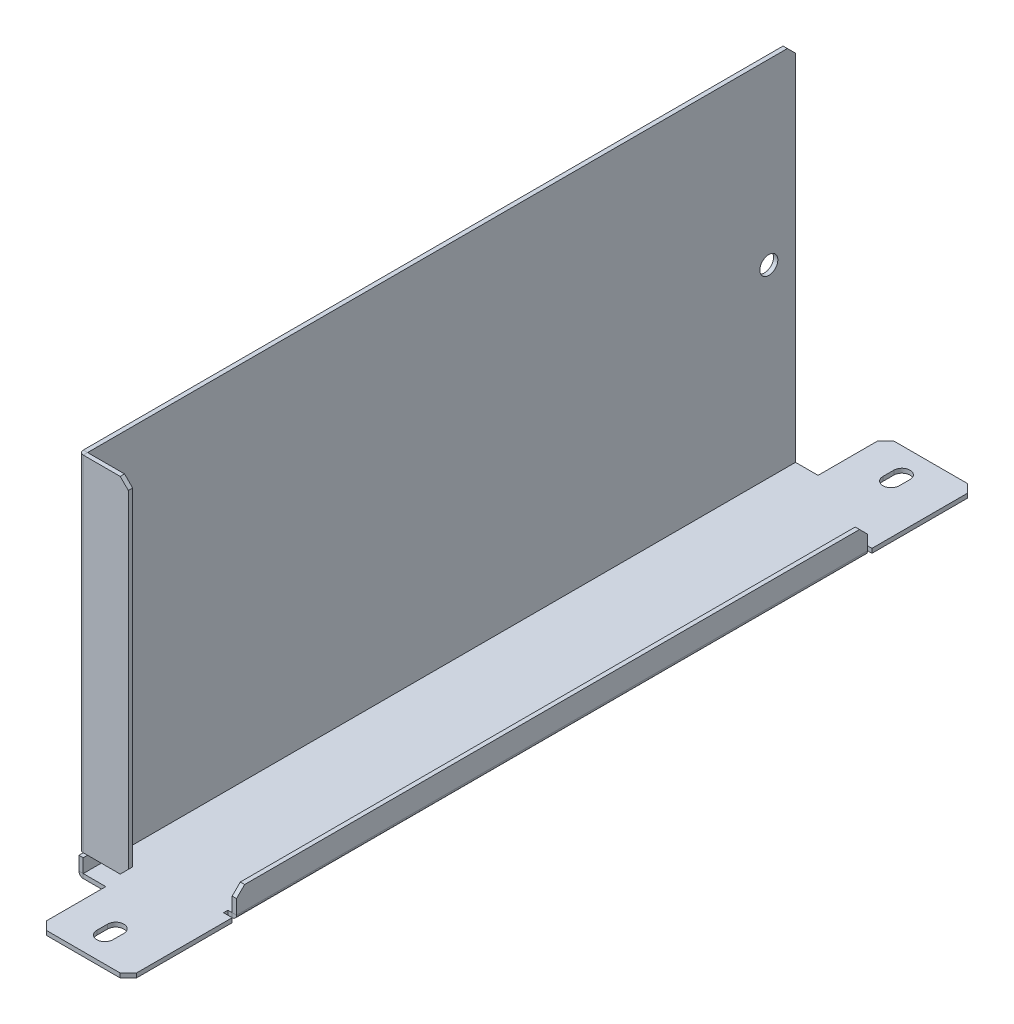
ISO-10303-21;
HEADER;
FILE_DESCRIPTION(('STEP AP214'),'2;1');
FILE_NAME('part.step','',(''),(''),'','','');
FILE_SCHEMA(('AUTOMOTIVE_DESIGN { 1 0 10303 214 1 1 1 1 }'));
ENDSEC;
DATA;
#1=APPLICATION_CONTEXT('core data for automotive mechanical design processes');
#2=APPLICATION_PROTOCOL_DEFINITION('international standard','automotive_design',2000,#1);
#3=PRODUCT_CONTEXT('',#1,'mechanical');
#4=PRODUCT('Part','Part','',(#3));
#5=PRODUCT_RELATED_PRODUCT_CATEGORY('part','',(#4));
#6=PRODUCT_DEFINITION_FORMATION('','',#4);
#7=PRODUCT_DEFINITION_CONTEXT('part definition',#1,'design');
#8=PRODUCT_DEFINITION('design','',#6,#7);
#9=PRODUCT_DEFINITION_SHAPE('','',#8);
#10=(LENGTH_UNIT() NAMED_UNIT(*) SI_UNIT(.MILLI.,.METRE.));
#11=(NAMED_UNIT(*) PLANE_ANGLE_UNIT() SI_UNIT($,.RADIAN.));
#12=(NAMED_UNIT(*) SI_UNIT($,.STERADIAN.) SOLID_ANGLE_UNIT());
#13=UNCERTAINTY_MEASURE_WITH_UNIT(LENGTH_MEASURE(1.E-05),#10,'distance_accuracy_value','');
#14=(GEOMETRIC_REPRESENTATION_CONTEXT(3) GLOBAL_UNCERTAINTY_ASSIGNED_CONTEXT((#13)) GLOBAL_UNIT_ASSIGNED_CONTEXT((#10,
#11,#12)) REPRESENTATION_CONTEXT('',''));
#15=CARTESIAN_POINT('',(0.,0.,0.));
#16=DIRECTION('',(0.,0.,1.));
#17=DIRECTION('',(1.,0.,0.));
#18=AXIS2_PLACEMENT_3D('',#15,#16,#17);
#19=CARTESIAN_POINT('',(31.75,-1.21920000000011,100.33));
#20=DIRECTION('',(-1.,0.,0.));
#21=DIRECTION('',(0.,-1.,0.));
#22=AXIS2_PLACEMENT_3D('',#19,#20,#21);
#23=PLANE('',#22);
#24=DIRECTION('',(0.,0.,1.));
#25=VECTOR('',#24,1.);
#26=CARTESIAN_POINT('',(31.75,-1.21920000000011,100.33));
#27=LINE('',#26,#25);
#28=CARTESIAN_POINT('',(31.75,-1.21920000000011,-117.094));
#29=VERTEX_POINT('',#28);
#30=CARTESIAN_POINT('',(31.75,-1.21920000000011,-90.1192));
#31=VERTEX_POINT('',#30);
#32=EDGE_CURVE('E560',#29,#31,#27,.T.);
#33=ORIENTED_EDGE('',*,*,#32,.F.);
#34=DIRECTION('',(0.,1.,0.));
#35=VECTOR('',#34,1.);
#36=CARTESIAN_POINT('',(31.75,-1.10805462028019E-13,-117.094));
#37=LINE('',#36,#35);
#38=CARTESIAN_POINT('',(31.75,-1.10854532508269E-13,-117.094));
#39=VERTEX_POINT('',#38);
#40=EDGE_CURVE('E736',#29,#39,#37,.T.);
#41=ORIENTED_EDGE('',*,*,#40,.T.);
#42=DIRECTION('',(0.,0.,1.));
#43=VECTOR('',#42,1.);
#44=CARTESIAN_POINT('',(31.75,-1.10854532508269E-13,100.33));
#45=LINE('',#44,#43);
#46=CARTESIAN_POINT('',(31.75,-1.13066824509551E-13,-90.1192));
#47=VERTEX_POINT('',#46);
#48=EDGE_CURVE('E570',#39,#47,#45,.T.);
#49=ORIENTED_EDGE('',*,*,#48,.T.);
#50=DIRECTION('',(0.,-1.,0.));
#51=VECTOR('',#50,1.);
#52=CARTESIAN_POINT('',(31.75,-1.13066824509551E-13,-90.1192));
#53=LINE('',#52,#51);
#54=EDGE_CURVE('E487',#47,#31,#53,.T.);
#55=ORIENTED_EDGE('',*,*,#54,.T.);
#56=EDGE_LOOP('',(#33,#41,#49,#55));
#57=FACE_BOUND('',#56,.T.);
#58=ADVANCED_FACE('F77',(#57),#23,.F.);
#59=CARTESIAN_POINT('',(31.75,-1.23475165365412E-13,90.1192));
#60=VERTEX_POINT('',#59);
#61=CARTESIAN_POINT('',(31.75,-1.10854532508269E-13,117.094));
#62=VERTEX_POINT('',#61);
#63=EDGE_CURVE('E569',#60,#62,#45,.T.);
#64=ORIENTED_EDGE('',*,*,#63,.T.);
#65=DIRECTION('',(0.,-1.,0.));
#66=VECTOR('',#65,1.);
#67=CARTESIAN_POINT('',(31.75,-1.21920000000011,117.094));
#68=LINE('',#67,#66);
#69=CARTESIAN_POINT('',(31.75,-1.21920000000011,117.094));
#70=VERTEX_POINT('',#69);
#71=EDGE_CURVE('E686',#62,#70,#68,.T.);
#72=ORIENTED_EDGE('',*,*,#71,.T.);
#73=CARTESIAN_POINT('',(31.75,-1.21920000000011,90.1192));
#74=VERTEX_POINT('',#73);
#75=EDGE_CURVE('E558',#74,#70,#27,.T.);
#76=ORIENTED_EDGE('',*,*,#75,.F.);
#77=DIRECTION('',(0.,-1.,0.));
#78=VECTOR('',#77,1.);
#79=CARTESIAN_POINT('',(31.75,-1.23475165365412E-13,90.1192));
#80=LINE('',#79,#78);
#81=EDGE_CURVE('E504',#60,#74,#80,.T.);
#82=ORIENTED_EDGE('',*,*,#81,.F.);
#83=EDGE_LOOP('',(#64,#72,#76,#82));
#84=FACE_BOUND('',#83,.T.);
#85=ADVANCED_FACE('F932',(#84),#23,.F.);
#86=CARTESIAN_POINT('',(0.,-1.2192,0.));
#87=DIRECTION('',(0.,1.,0.));
#88=DIRECTION('',(-1.,0.,0.));
#89=AXIS2_PLACEMENT_3D('',#86,#87,#88);
#90=PLANE('',#89);
#91=DIRECTION('',(0.,0.,-1.));
#92=VECTOR('',#91,1.);
#93=CARTESIAN_POINT('',(15.748,-1.21920000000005,-109.22));
#94=LINE('',#93,#92);
#95=CARTESIAN_POINT('',(15.748,-1.21920000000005,-109.22));
#96=VERTEX_POINT('',#95);
#97=CARTESIAN_POINT('',(15.748,-1.21920000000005,-112.268));
#98=VERTEX_POINT('',#97);
#99=EDGE_CURVE('E396',#96,#98,#94,.T.);
#100=ORIENTED_EDGE('',*,*,#99,.F.);
#101=CARTESIAN_POINT('',(18.034,-1.21920000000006,-109.22));
#102=DIRECTION('',(0.,-1.,0.));
#103=DIRECTION('',(1.,0.,0.));
#104=AXIS2_PLACEMENT_3D('',#101,#102,#103);
#105=CIRCLE('',#104,2.286);
#106=CARTESIAN_POINT('',(20.32,-1.21920000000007,-109.22));
#107=VERTEX_POINT('',#106);
#108=EDGE_CURVE('E92',#107,#96,#105,.T.);
#109=ORIENTED_EDGE('',*,*,#108,.F.);
#110=DIRECTION('',(0.,0.,1.));
#111=VECTOR('',#110,1.);
#112=CARTESIAN_POINT('',(20.32,-1.21920000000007,-109.22));
#113=LINE('',#112,#111);
#114=CARTESIAN_POINT('',(20.32,-1.21920000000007,-112.268));
#115=VERTEX_POINT('',#114);
#116=EDGE_CURVE('E387',#115,#107,#113,.T.);
#117=ORIENTED_EDGE('',*,*,#116,.F.);
#118=CARTESIAN_POINT('',(18.034,-1.21920000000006,-112.268));
#119=DIRECTION('',(0.,-1.,0.));
#120=DIRECTION('',(1.,0.,0.));
#121=AXIS2_PLACEMENT_3D('',#118,#119,#120);
#122=CIRCLE('',#121,2.286);
#123=EDGE_CURVE('E390',#98,#115,#122,.T.);
#124=ORIENTED_EDGE('',*,*,#123,.F.);
#125=EDGE_LOOP('',(#100,#109,#117,#124));
#126=FACE_BOUND('',#125,.T.);
#127=DIRECTION('',(0.,0.,-1.));
#128=VECTOR('',#127,1.);
#129=CARTESIAN_POINT('',(15.748,-1.21920000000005,112.268));
#130=LINE('',#129,#128);
#131=CARTESIAN_POINT('',(15.748,-1.21920000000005,112.268));
#132=VERTEX_POINT('',#131);
#133=CARTESIAN_POINT('',(15.748,-1.21920000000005,109.22));
#134=VERTEX_POINT('',#133);
#135=EDGE_CURVE('E421',#132,#134,#130,.T.);
#136=ORIENTED_EDGE('',*,*,#135,.F.);
#137=CARTESIAN_POINT('',(18.0339999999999,-1.21920000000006,112.268));
#138=DIRECTION('',(0.,-1.,0.));
#139=DIRECTION('',(1.,0.,0.));
#140=AXIS2_PLACEMENT_3D('',#137,#138,#139);
#141=CIRCLE('',#140,2.286);
#142=CARTESIAN_POINT('',(20.3199999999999,-1.21920000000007,112.268));
#143=VERTEX_POINT('',#142);
#144=EDGE_CURVE('E402',#143,#132,#141,.T.);
#145=ORIENTED_EDGE('',*,*,#144,.F.);
#146=DIRECTION('',(0.,0.,1.));
#147=VECTOR('',#146,1.);
#148=CARTESIAN_POINT('',(20.3199999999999,-1.21920000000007,112.268));
#149=LINE('',#148,#147);
#150=CARTESIAN_POINT('',(20.3199999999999,-1.21920000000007,109.22));
#151=VERTEX_POINT('',#150);
#152=EDGE_CURVE('E410',#151,#143,#149,.T.);
#153=ORIENTED_EDGE('',*,*,#152,.F.);
#154=CARTESIAN_POINT('',(18.0339999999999,-1.21920000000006,109.22));
#155=DIRECTION('',(0.,-1.,0.));
#156=DIRECTION('',(1.,0.,0.));
#157=AXIS2_PLACEMENT_3D('',#154,#155,#156);
#158=CIRCLE('',#157,2.286);
#159=EDGE_CURVE('E424',#134,#151,#158,.T.);
#160=ORIENTED_EDGE('',*,*,#159,.F.);
#161=EDGE_LOOP('',(#136,#145,#153,#160));
#162=FACE_BOUND('',#161,.T.);
#163=DIRECTION('',(1.,0.,0.));
#164=VECTOR('',#163,1.);
#165=CARTESIAN_POINT('',(31.75,-1.21920000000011,-119.38));
#166=LINE('',#165,#164);
#167=CARTESIAN_POINT('',(8.63600000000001,-1.21920000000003,-119.38));
#168=VERTEX_POINT('',#167);
#169=CARTESIAN_POINT('',(29.464,-1.2192000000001,-119.38));
#170=VERTEX_POINT('',#169);
#171=EDGE_CURVE('E534',#168,#170,#166,.T.);
#172=ORIENTED_EDGE('',*,*,#171,.T.);
#173=DIRECTION('',(0.707106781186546,0.,0.707106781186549));
#174=VECTOR('',#173,1.);
#175=CARTESIAN_POINT('',(29.464,-1.2192000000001,-119.38));
#176=LINE('',#175,#174);
#177=EDGE_CURVE('E734',#170,#29,#176,.T.);
#178=ORIENTED_EDGE('',*,*,#177,.T.);
#179=ORIENTED_EDGE('',*,*,#32,.T.);
#180=DIRECTION('',(1.,0.,0.));
#181=VECTOR('',#180,1.);
#182=CARTESIAN_POINT('',(0.,-1.2192,-90.1192));
#183=LINE('',#182,#181);
#184=CARTESIAN_POINT('',(29.3116,-1.2192000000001,-90.1192));
#185=VERTEX_POINT('',#184);
#186=EDGE_CURVE('E526',#185,#31,#183,.T.);
#187=ORIENTED_EDGE('',*,*,#186,.F.);
#188=DIRECTION('',(0.,0.,-1.));
#189=VECTOR('',#188,1.);
#190=CARTESIAN_POINT('',(29.3116,-1.2192000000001,0.));
#191=LINE('',#190,#189);
#192=CARTESIAN_POINT('',(29.3116,-1.2192000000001,-88.9));
#193=VERTEX_POINT('',#192);
#194=EDGE_CURVE('E524',#193,#185,#191,.T.);
#195=ORIENTED_EDGE('',*,*,#194,.F.);
#196=DIRECTION('',(-1.,0.,0.));
#197=VECTOR('',#196,1.);
#198=CARTESIAN_POINT('',(0.,-1.2192,-88.9));
#199=LINE('',#198,#197);
#200=CARTESIAN_POINT('',(30.5308,-1.21920000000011,-88.9));
#201=VERTEX_POINT('',#200);
#202=EDGE_CURVE('E522',#201,#193,#199,.T.);
#203=ORIENTED_EDGE('',*,*,#202,.F.);
#204=DIRECTION('',(0.,0.,-1.));
#205=VECTOR('',#204,1.);
#206=CARTESIAN_POINT('',(30.5308,-1.21920000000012,0.));
#207=LINE('',#206,#205);
#208=CARTESIAN_POINT('',(30.5308,-1.21920000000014,88.9));
#209=VERTEX_POINT('',#208);
#210=EDGE_CURVE('E471',#209,#201,#207,.T.);
#211=ORIENTED_EDGE('',*,*,#210,.F.);
#212=DIRECTION('',(1.,0.,0.));
#213=VECTOR('',#212,1.);
#214=CARTESIAN_POINT('',(0.,-1.2192,88.9));
#215=LINE('',#214,#213);
#216=CARTESIAN_POINT('',(29.3116,-1.2192000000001,88.9));
#217=VERTEX_POINT('',#216);
#218=EDGE_CURVE('E519',#217,#209,#215,.T.);
#219=ORIENTED_EDGE('',*,*,#218,.F.);
#220=DIRECTION('',(0.,0.,-1.));
#221=VECTOR('',#220,1.);
#222=CARTESIAN_POINT('',(29.3116,-1.2192000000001,0.));
#223=LINE('',#222,#221);
#224=CARTESIAN_POINT('',(29.3116,-1.21920000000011,90.1192));
#225=VERTEX_POINT('',#224);
#226=EDGE_CURVE('E517',#225,#217,#223,.T.);
#227=ORIENTED_EDGE('',*,*,#226,.F.);
#228=DIRECTION('',(-1.,0.,0.));
#229=VECTOR('',#228,1.);
#230=CARTESIAN_POINT('',(0.,-1.2192,90.1192));
#231=LINE('',#230,#229);
#232=EDGE_CURVE('E486',#74,#225,#231,.T.);
#233=ORIENTED_EDGE('',*,*,#232,.F.);
#234=ORIENTED_EDGE('',*,*,#75,.T.);
#235=DIRECTION('',(-0.707106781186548,0.,0.707106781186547));
#236=VECTOR('',#235,1.);
#237=CARTESIAN_POINT('',(31.75,-1.21920000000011,117.094));
#238=LINE('',#237,#236);
#239=CARTESIAN_POINT('',(29.464,-1.2192000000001,119.38));
#240=VERTEX_POINT('',#239);
#241=EDGE_CURVE('E689',#70,#240,#238,.T.);
#242=ORIENTED_EDGE('',*,*,#241,.T.);
#243=DIRECTION('',(-1.,0.,0.));
#244=VECTOR('',#243,1.);
#245=CARTESIAN_POINT('',(31.75,-1.21920000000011,119.38));
#246=LINE('',#245,#244);
#247=CARTESIAN_POINT('',(8.63599999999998,-1.21920000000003,119.38));
#248=VERTEX_POINT('',#247);
#249=EDGE_CURVE('E543',#240,#248,#246,.T.);
#250=ORIENTED_EDGE('',*,*,#249,.T.);
#251=DIRECTION('',(0.707106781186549,0.,0.707106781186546));
#252=VECTOR('',#251,1.);
#253=CARTESIAN_POINT('',(8.63599999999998,-1.21920000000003,119.38));
#254=LINE('',#253,#252);
#255=CARTESIAN_POINT('',(6.34999999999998,-1.21920000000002,117.094));
#256=VERTEX_POINT('',#255);
#257=EDGE_CURVE('E679',#248,#256,#254,.F.);
#258=ORIENTED_EDGE('',*,*,#257,.T.);
#259=DIRECTION('',(0.,0.,-1.));
#260=VECTOR('',#259,1.);
#261=CARTESIAN_POINT('',(6.34999999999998,-1.21920000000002,100.33));
#262=LINE('',#261,#260);
#263=CARTESIAN_POINT('',(6.34999999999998,-1.21920000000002,100.33));
#264=VERTEX_POINT('',#263);
#265=EDGE_CURVE('E547',#256,#264,#262,.T.);
#266=ORIENTED_EDGE('',*,*,#265,.T.);
#267=DIRECTION('',(-1.,0.,0.));
#268=VECTOR('',#267,1.);
#269=CARTESIAN_POINT('',(0.,-1.2192,100.33));
#270=LINE('',#269,#268);
#271=CARTESIAN_POINT('',(0.,-1.2192,100.33));
#272=VERTEX_POINT('',#271);
#273=EDGE_CURVE('E562',#264,#272,#270,.T.);
#274=ORIENTED_EDGE('',*,*,#273,.T.);
#275=DIRECTION('',(0.,0.,-1.));
#276=VECTOR('',#275,1.);
#277=CARTESIAN_POINT('',(0.,-1.2192,-100.33));
#278=LINE('',#277,#276);
#279=CARTESIAN_POINT('',(0.,-1.2192,-100.33));
#280=VERTEX_POINT('',#279);
#281=EDGE_CURVE('E564',#272,#280,#278,.T.);
#282=ORIENTED_EDGE('',*,*,#281,.T.);
#283=DIRECTION('',(1.,0.,0.));
#284=VECTOR('',#283,1.);
#285=CARTESIAN_POINT('',(31.75,-1.21920000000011,-100.33));
#286=LINE('',#285,#284);
#287=CARTESIAN_POINT('',(6.35,-1.21920000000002,-100.33));
#288=VERTEX_POINT('',#287);
#289=EDGE_CURVE('E555',#280,#288,#286,.T.);
#290=ORIENTED_EDGE('',*,*,#289,.T.);
#291=DIRECTION('',(0.,0.,-1.));
#292=VECTOR('',#291,1.);
#293=CARTESIAN_POINT('',(6.35,-1.21920000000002,-100.33));
#294=LINE('',#293,#292);
#295=CARTESIAN_POINT('',(6.35,-1.21920000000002,-117.094));
#296=VERTEX_POINT('',#295);
#297=EDGE_CURVE('E529',#288,#296,#294,.T.);
#298=ORIENTED_EDGE('',*,*,#297,.T.);
#299=DIRECTION('',(-0.707106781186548,0.,0.707106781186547));
#300=VECTOR('',#299,1.);
#301=CARTESIAN_POINT('',(6.35000000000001,-1.21920000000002,-117.094));
#302=LINE('',#301,#300);
#303=EDGE_CURVE('E725',#296,#168,#302,.F.);
#304=ORIENTED_EDGE('',*,*,#303,.T.);
#305=EDGE_LOOP('',(#172,#178,#179,#187,#195,#203,#211,#219,#227,#233,#234,#242,#250,#258,#266,
#274,#282,#290,#298,#304));
#306=FACE_BOUND('',#305,.T.);
#307=ADVANCED_FACE('F830',(#126,#162,#306),#90,.F.);
#308=CARTESIAN_POINT('',(0.,0.,0.));
#309=DIRECTION('',(0.,1.,0.));
#310=DIRECTION('',(-1.,0.,0.));
#311=AXIS2_PLACEMENT_3D('',#308,#309,#310);
#312=PLANE('',#311);
#313=CARTESIAN_POINT('',(18.034,0.,-109.22));
#314=DIRECTION('',(0.,-1.,0.));
#315=DIRECTION('',(1.,0.,0.));
#316=AXIS2_PLACEMENT_3D('',#313,#314,#315);
#317=CIRCLE('',#316,2.286);
#318=CARTESIAN_POINT('',(20.32,0.,-109.22));
#319=VERTEX_POINT('',#318);
#320=CARTESIAN_POINT('',(15.748,0.,-109.22));
#321=VERTEX_POINT('',#320);
#322=EDGE_CURVE('E371',#319,#321,#317,.T.);
#323=ORIENTED_EDGE('',*,*,#322,.T.);
#324=DIRECTION('',(0.,0.,-1.));
#325=VECTOR('',#324,1.);
#326=CARTESIAN_POINT('',(15.748,0.,-109.22));
#327=LINE('',#326,#325);
#328=CARTESIAN_POINT('',(15.748,0.,-112.268));
#329=VERTEX_POINT('',#328);
#330=EDGE_CURVE('E380',#321,#329,#327,.T.);
#331=ORIENTED_EDGE('',*,*,#330,.T.);
#332=CARTESIAN_POINT('',(18.034,0.,-112.268));
#333=DIRECTION('',(0.,-1.,0.));
#334=DIRECTION('',(1.,0.,0.));
#335=AXIS2_PLACEMENT_3D('',#332,#333,#334);
#336=CIRCLE('',#335,2.286);
#337=CARTESIAN_POINT('',(20.32,0.,-112.268));
#338=VERTEX_POINT('',#337);
#339=EDGE_CURVE('E100',#329,#338,#336,.T.);
#340=ORIENTED_EDGE('',*,*,#339,.T.);
#341=DIRECTION('',(0.,0.,1.));
#342=VECTOR('',#341,1.);
#343=CARTESIAN_POINT('',(20.32,0.,-109.22));
#344=LINE('',#343,#342);
#345=EDGE_CURVE('E377',#338,#319,#344,.T.);
#346=ORIENTED_EDGE('',*,*,#345,.T.);
#347=EDGE_LOOP('',(#323,#331,#340,#346));
#348=FACE_BOUND('',#347,.T.);
#349=CARTESIAN_POINT('',(18.034,0.,112.268));
#350=DIRECTION('',(0.,-1.,0.));
#351=DIRECTION('',(1.,0.,0.));
#352=AXIS2_PLACEMENT_3D('',#349,#350,#351);
#353=CIRCLE('',#352,2.286);
#354=CARTESIAN_POINT('',(20.32,0.,112.268));
#355=VERTEX_POINT('',#354);
#356=CARTESIAN_POINT('',(15.748,0.,112.268));
#357=VERTEX_POINT('',#356);
#358=EDGE_CURVE('E406',#355,#357,#353,.T.);
#359=ORIENTED_EDGE('',*,*,#358,.T.);
#360=DIRECTION('',(0.,0.,-1.));
#361=VECTOR('',#360,1.);
#362=CARTESIAN_POINT('',(15.748,0.,112.268));
#363=LINE('',#362,#361);
#364=CARTESIAN_POINT('',(15.748,0.,109.22));
#365=VERTEX_POINT('',#364);
#366=EDGE_CURVE('E409',#357,#365,#363,.T.);
#367=ORIENTED_EDGE('',*,*,#366,.T.);
#368=CARTESIAN_POINT('',(18.034,0.,109.22));
#369=DIRECTION('',(0.,-1.,0.));
#370=DIRECTION('',(1.,0.,0.));
#371=AXIS2_PLACEMENT_3D('',#368,#369,#370);
#372=CIRCLE('',#371,2.286);
#373=CARTESIAN_POINT('',(20.32,0.,109.22));
#374=VERTEX_POINT('',#373);
#375=EDGE_CURVE('E413',#365,#374,#372,.T.);
#376=ORIENTED_EDGE('',*,*,#375,.T.);
#377=DIRECTION('',(0.,0.,1.));
#378=VECTOR('',#377,1.);
#379=CARTESIAN_POINT('',(20.32,0.,112.268));
#380=LINE('',#379,#378);
#381=EDGE_CURVE('E416',#374,#355,#380,.T.);
#382=ORIENTED_EDGE('',*,*,#381,.T.);
#383=EDGE_LOOP('',(#359,#367,#376,#382));
#384=FACE_BOUND('',#383,.T.);
#385=ORIENTED_EDGE('',*,*,#48,.F.);
#386=DIRECTION('',(-0.707106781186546,0.,-0.707106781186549));
#387=VECTOR('',#386,1.);
#388=CARTESIAN_POINT('',(74.4220000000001,-2.59843024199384E-13,-74.4219999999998));
#389=LINE('',#388,#387);
#390=CARTESIAN_POINT('',(29.464,-1.02848285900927E-13,-119.38));
#391=VERTEX_POINT('',#390);
#392=EDGE_CURVE('E738',#39,#391,#389,.T.);
#393=ORIENTED_EDGE('',*,*,#392,.T.);
#394=DIRECTION('',(1.,0.,0.));
#395=VECTOR('',#394,1.);
#396=CARTESIAN_POINT('',(31.75,-1.10805462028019E-13,-119.38));
#397=LINE('',#396,#395);
#398=CARTESIAN_POINT('',(8.63600000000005,0.,-119.38));
#399=VERTEX_POINT('',#398);
#400=EDGE_CURVE('E533',#399,#391,#397,.T.);
#401=ORIENTED_EDGE('',*,*,#400,.F.);
#402=DIRECTION('',(0.707106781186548,0.,-0.707106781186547));
#403=VECTOR('',#402,1.);
#404=CARTESIAN_POINT('',(-55.372,1.93330304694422E-13,-55.3720000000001));
#405=LINE('',#404,#403);
#406=CARTESIAN_POINT('',(6.35000000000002,0.,-117.094));
#407=VERTEX_POINT('',#406);
#408=EDGE_CURVE('E729',#399,#407,#405,.F.);
#409=ORIENTED_EDGE('',*,*,#408,.T.);
#410=DIRECTION('',(0.,0.,-1.));
#411=VECTOR('',#410,1.);
#412=CARTESIAN_POINT('',(6.35000000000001,0.,-100.33));
#413=LINE('',#412,#411);
#414=CARTESIAN_POINT('',(6.35,0.,-100.33));
#415=VERTEX_POINT('',#414);
#416=EDGE_CURVE('E530',#415,#407,#413,.T.);
#417=ORIENTED_EDGE('',*,*,#416,.F.);
#418=DIRECTION('',(1.,0.,0.));
#419=VECTOR('',#418,1.);
#420=CARTESIAN_POINT('',(31.75,-1.10854532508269E-13,-100.33));
#421=LINE('',#420,#419);
#422=CARTESIAN_POINT('',(0.,0.,-100.33));
#423=VERTEX_POINT('',#422);
#424=EDGE_CURVE('E554',#423,#415,#421,.T.);
#425=ORIENTED_EDGE('',*,*,#424,.F.);
#426=DIRECTION('',(0.,0.,1.));
#427=VECTOR('',#426,1.);
#428=CARTESIAN_POINT('',(0.,0.,100.33));
#429=LINE('',#428,#427);
#430=CARTESIAN_POINT('',(0.,0.,100.33));
#431=VERTEX_POINT('',#430);
#432=EDGE_CURVE('E662',#423,#431,#429,.T.);
#433=ORIENTED_EDGE('',*,*,#432,.T.);
#434=DIRECTION('',(-1.,0.,0.));
#435=VECTOR('',#434,1.);
#436=CARTESIAN_POINT('',(0.,0.,100.33));
#437=LINE('',#436,#435);
#438=CARTESIAN_POINT('',(6.34999999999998,0.,100.33));
#439=VERTEX_POINT('',#438);
#440=EDGE_CURVE('E559',#439,#431,#437,.T.);
#441=ORIENTED_EDGE('',*,*,#440,.F.);
#442=DIRECTION('',(0.,0.,-1.));
#443=VECTOR('',#442,1.);
#444=CARTESIAN_POINT('',(6.34999999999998,0.,100.33));
#445=LINE('',#444,#443);
#446=CARTESIAN_POINT('',(6.34999999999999,0.,117.094));
#447=VERTEX_POINT('',#446);
#448=EDGE_CURVE('E546',#447,#439,#445,.T.);
#449=ORIENTED_EDGE('',*,*,#448,.F.);
#450=DIRECTION('',(-0.707106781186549,0.,-0.707106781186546));
#451=VECTOR('',#450,1.);
#452=CARTESIAN_POINT('',(-55.372,1.93330304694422E-13,55.3720000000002));
#453=LINE('',#452,#451);
#454=CARTESIAN_POINT('',(8.63600000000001,0.,119.38));
#455=VERTEX_POINT('',#454);
#456=EDGE_CURVE('E683',#447,#455,#453,.F.);
#457=ORIENTED_EDGE('',*,*,#456,.T.);
#458=DIRECTION('',(-1.,0.,0.));
#459=VECTOR('',#458,1.);
#460=CARTESIAN_POINT('',(31.75,-1.10805462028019E-13,119.38));
#461=LINE('',#460,#459);
#462=CARTESIAN_POINT('',(29.464,-1.02848285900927E-13,119.38));
#463=VERTEX_POINT('',#462);
#464=EDGE_CURVE('E544',#463,#455,#461,.T.);
#465=ORIENTED_EDGE('',*,*,#464,.F.);
#466=DIRECTION('',(0.707106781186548,0.,-0.707106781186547));
#467=VECTOR('',#466,1.);
#468=CARTESIAN_POINT('',(74.422,-2.59843024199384E-13,74.4220000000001));
#469=LINE('',#468,#467);
#470=EDGE_CURVE('E693',#463,#62,#469,.T.);
#471=ORIENTED_EDGE('',*,*,#470,.T.);
#472=ORIENTED_EDGE('',*,*,#63,.F.);
#473=DIRECTION('',(1.,0.,0.));
#474=VECTOR('',#473,1.);
#475=CARTESIAN_POINT('',(29.3116,-1.2758217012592E-13,90.1192));
#476=LINE('',#475,#474);
#477=CARTESIAN_POINT('',(29.3116,-1.02340904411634E-13,90.1192));
#478=VERTEX_POINT('',#477);
#479=EDGE_CURVE('E502',#478,#60,#476,.T.);
#480=ORIENTED_EDGE('',*,*,#479,.F.);
#481=DIRECTION('',(0.,0.,1.));
#482=VECTOR('',#481,1.);
#483=CARTESIAN_POINT('',(29.3116,-1.2758217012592E-13,88.9));
#484=LINE('',#483,#482);
#485=CARTESIAN_POINT('',(29.3116,-1.2758217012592E-13,88.9));
#486=VERTEX_POINT('',#485);
#487=EDGE_CURVE('E499',#486,#478,#484,.T.);
#488=ORIENTED_EDGE('',*,*,#487,.F.);
#489=DIRECTION('',(-1.,0.,0.));
#490=VECTOR('',#489,1.);
#491=CARTESIAN_POINT('',(30.5308,-1.31838984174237E-13,88.9));
#492=LINE('',#491,#490);
#493=CARTESIAN_POINT('',(30.5308,-1.31838984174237E-13,88.9));
#494=VERTEX_POINT('',#493);
#495=EDGE_CURVE('E496',#494,#486,#492,.T.);
#496=ORIENTED_EDGE('',*,*,#495,.F.);
#497=DIRECTION('',(0.,0.,1.));
#498=VECTOR('',#497,1.);
#499=CARTESIAN_POINT('',(30.5308,-1.10281371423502E-13,-88.9));
#500=LINE('',#499,#498);
#501=CARTESIAN_POINT('',(30.5308,-1.10258153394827E-13,-88.9));
#502=VERTEX_POINT('',#501);
#503=EDGE_CURVE('E441',#494,#502,#500,.F.);
#504=ORIENTED_EDGE('',*,*,#503,.T.);
#505=DIRECTION('',(1.,0.,0.));
#506=VECTOR('',#505,1.);
#507=CARTESIAN_POINT('',(29.3116,-1.06765488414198E-13,-88.9));
#508=LINE('',#507,#506);
#509=CARTESIAN_POINT('',(29.3116,-1.06765488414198E-13,-88.9));
#510=VERTEX_POINT('',#509);
#511=EDGE_CURVE('E492',#510,#502,#508,.T.);
#512=ORIENTED_EDGE('',*,*,#511,.F.);
#513=DIRECTION('',(0.,0.,1.));
#514=VECTOR('',#513,1.);
#515=CARTESIAN_POINT('',(29.3116,-1.06765488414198E-13,-90.1192));
#516=LINE('',#515,#514);
#517=CARTESIAN_POINT('',(29.3116,-1.06765488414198E-13,-90.1192));
#518=VERTEX_POINT('',#517);
#519=EDGE_CURVE('E488',#518,#510,#516,.T.);
#520=ORIENTED_EDGE('',*,*,#519,.F.);
#521=DIRECTION('',(-1.,0.,0.));
#522=VECTOR('',#521,1.);
#523=CARTESIAN_POINT('',(31.75,-1.13066824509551E-13,-90.1192));
#524=LINE('',#523,#522);
#525=EDGE_CURVE('E483',#47,#518,#524,.T.);
#526=ORIENTED_EDGE('',*,*,#525,.F.);
#527=EDGE_LOOP('',(#385,#393,#401,#409,#417,#425,#433,#441,#449,#457,#465,#471,#472,#480,#488,
#496,#504,#512,#520,#526));
#528=FACE_BOUND('',#527,.T.);
#529=ADVANCED_FACE('F384',(#348,#384,#528),#312,.T.);
#530=CARTESIAN_POINT('',(-1.2192,102.108,100.33));
#531=DIRECTION('',(1.,0.,0.));
#532=DIRECTION('',(0.,0.,-1.));
#533=AXIS2_PLACEMENT_3D('',#530,#531,#532);
#534=PLANE('',#533);
#535=CARTESIAN_POINT('',(-1.21920000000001,51.9176000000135,-92.8116000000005));
#536=DIRECTION('',(-1.,0.,0.));
#537=DIRECTION('',(0.,0.,1.));
#538=AXIS2_PLACEMENT_3D('',#535,#536,#537);
#539=CIRCLE('',#538,2.53999999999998);
#540=CARTESIAN_POINT('',(-1.21920000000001,51.9176000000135,-90.2716000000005));
#541=VERTEX_POINT('',#540);
#542=EDGE_CURVE('E431',#541,#541,#539,.T.);
#543=ORIENTED_EDGE('',*,*,#542,.F.);
#544=EDGE_LOOP('',(#543));
#545=FACE_BOUND('',#544,.T.);
#546=DIRECTION('',(0.,0.,-1.));
#547=VECTOR('',#546,1.);
#548=CARTESIAN_POINT('',(-1.2192,102.108,100.33));
#549=LINE('',#548,#547);
#550=CARTESIAN_POINT('',(-1.2192,102.108,-98.0439999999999));
#551=VERTEX_POINT('',#550);
#552=CARTESIAN_POINT('',(-1.2192,102.108,99.1108));
#553=VERTEX_POINT('',#552);
#554=EDGE_CURVE('E652',#551,#553,#549,.F.);
#555=ORIENTED_EDGE('',*,*,#554,.F.);
#556=DIRECTION('',(0.,0.707106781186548,0.707106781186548));
#557=VECTOR('',#556,1.);
#558=CARTESIAN_POINT('',(-1.2192,99.822,-100.33));
#559=LINE('',#558,#557);
#560=CARTESIAN_POINT('',(-1.2192,99.822,-100.33));
#561=VERTEX_POINT('',#560);
#562=EDGE_CURVE('E720',#551,#561,#559,.F.);
#563=ORIENTED_EDGE('',*,*,#562,.T.);
#564=DIRECTION('',(0.,-1.,0.));
#565=VECTOR('',#564,1.);
#566=CARTESIAN_POINT('',(-1.2192,102.108,-100.33));
#567=LINE('',#566,#565);
#568=CARTESIAN_POINT('',(-1.2192,0.,-100.33));
#569=VERTEX_POINT('',#568);
#570=EDGE_CURVE('E657',#561,#569,#567,.T.);
#571=ORIENTED_EDGE('',*,*,#570,.T.);
#572=DIRECTION('',(0.,0.,-1.));
#573=VECTOR('',#572,1.);
#574=CARTESIAN_POINT('',(-1.2192,0.,100.33));
#575=LINE('',#574,#573);
#576=CARTESIAN_POINT('',(-1.2192,0.,100.33));
#577=VERTEX_POINT('',#576);
#578=EDGE_CURVE('E651',#569,#577,#575,.F.);
#579=ORIENTED_EDGE('',*,*,#578,.T.);
#580=DIRECTION('',(0.,-1.,0.));
#581=VECTOR('',#580,1.);
#582=CARTESIAN_POINT('',(-1.2192,102.108,100.33));
#583=LINE('',#582,#581);
#584=CARTESIAN_POINT('',(-1.2192,3.8608,100.33));
#585=VERTEX_POINT('',#584);
#586=EDGE_CURVE('E673',#585,#577,#583,.T.);
#587=ORIENTED_EDGE('',*,*,#586,.F.);
#588=DIRECTION('',(0.,0.,1.));
#589=VECTOR('',#588,1.);
#590=CARTESIAN_POINT('',(-1.2192,3.8608,100.33));
#591=LINE('',#590,#589);
#592=CARTESIAN_POINT('',(-1.2192,3.8608,97.8916));
#593=VERTEX_POINT('',#592);
#594=EDGE_CURVE('E648',#593,#585,#591,.T.);
#595=ORIENTED_EDGE('',*,*,#594,.F.);
#596=DIRECTION('',(0.,-1.,0.));
#597=VECTOR('',#596,1.);
#598=CARTESIAN_POINT('',(-1.2192,102.108,97.8916));
#599=LINE('',#598,#597);
#600=CARTESIAN_POINT('',(-1.2192,5.08,97.8916));
#601=VERTEX_POINT('',#600);
#602=EDGE_CURVE('E645',#601,#593,#599,.T.);
#603=ORIENTED_EDGE('',*,*,#602,.F.);
#604=DIRECTION('',(0.,0.,-1.));
#605=VECTOR('',#604,1.);
#606=CARTESIAN_POINT('',(-1.2192,5.08,100.33));
#607=LINE('',#606,#605);
#608=CARTESIAN_POINT('',(-1.2192,5.08,99.1108));
#609=VERTEX_POINT('',#608);
#610=EDGE_CURVE('E629',#609,#601,#607,.T.);
#611=ORIENTED_EDGE('',*,*,#610,.F.);
#612=DIRECTION('',(0.,-1.,0.));
#613=VECTOR('',#612,1.);
#614=CARTESIAN_POINT('',(-1.2192,0.,99.1108));
#615=LINE('',#614,#613);
#616=EDGE_CURVE('E614',#553,#609,#615,.T.);
#617=ORIENTED_EDGE('',*,*,#616,.F.);
#618=EDGE_LOOP('',(#555,#563,#571,#579,#587,#595,#603,#611,#617));
#619=FACE_BOUND('',#618,.T.);
#620=ADVANCED_FACE('F896',(#545,#619),#534,.F.);
#621=CARTESIAN_POINT('',(0.,102.108,100.33));
#622=DIRECTION('',(0.,0.,1.));
#623=DIRECTION('',(1.,0.,0.));
#624=AXIS2_PLACEMENT_3D('',#621,#622,#623);
#625=PLANE('',#624);
#626=DIRECTION('',(0.,-1.,0.));
#627=VECTOR('',#626,1.);
#628=CARTESIAN_POINT('',(0.,102.108,100.33));
#629=LINE('',#628,#627);
#630=CARTESIAN_POINT('',(0.,3.8608,100.33));
#631=VERTEX_POINT('',#630);
#632=EDGE_CURVE('E670',#631,#431,#629,.T.);
#633=ORIENTED_EDGE('',*,*,#632,.F.);
#634=DIRECTION('',(-1.,0.,0.));
#635=VECTOR('',#634,1.);
#636=CARTESIAN_POINT('',(0.,3.8608,100.33));
#637=LINE('',#636,#635);
#638=EDGE_CURVE('E630',#631,#585,#637,.T.);
#639=ORIENTED_EDGE('',*,*,#638,.T.);
#640=ORIENTED_EDGE('',*,*,#586,.T.);
#641=DIRECTION('',(-1.,0.,0.));
#642=VECTOR('',#641,1.);
#643=CARTESIAN_POINT('',(0.,0.,100.33));
#644=LINE('',#643,#642);
#645=EDGE_CURVE('E659',#431,#577,#644,.T.);
#646=ORIENTED_EDGE('',*,*,#645,.F.);
#647=EDGE_LOOP('',(#633,#639,#640,#646));
#648=FACE_BOUND('',#647,.T.);
#649=ADVANCED_FACE('F893',(#648),#625,.T.);
#650=CARTESIAN_POINT('',(0.,102.108,100.33));
#651=DIRECTION('',(1.,0.,0.));
#652=DIRECTION('',(0.,0.,-1.));
#653=AXIS2_PLACEMENT_3D('',#650,#651,#652);
#654=PLANE('',#653);
#655=CARTESIAN_POINT('',(0.,51.9176000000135,-92.8116000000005));
#656=DIRECTION('',(-1.,0.,0.));
#657=DIRECTION('',(0.,0.,1.));
#658=AXIS2_PLACEMENT_3D('',#655,#656,#657);
#659=CIRCLE('',#658,2.53999999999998);
#660=CARTESIAN_POINT('',(0.,51.9176000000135,-90.2716000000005));
#661=VERTEX_POINT('',#660);
#662=EDGE_CURVE('E438',#661,#661,#659,.T.);
#663=ORIENTED_EDGE('',*,*,#662,.T.);
#664=EDGE_LOOP('',(#663));
#665=FACE_BOUND('',#664,.T.);
#666=DIRECTION('',(0.,-1.,0.));
#667=VECTOR('',#666,1.);
#668=CARTESIAN_POINT('',(0.,102.108,-100.33));
#669=LINE('',#668,#667);
#670=CARTESIAN_POINT('',(0.,99.822,-100.33));
#671=VERTEX_POINT('',#670);
#672=EDGE_CURVE('E668',#671,#423,#669,.T.);
#673=ORIENTED_EDGE('',*,*,#672,.F.);
#674=DIRECTION('',(0.,-0.707106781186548,-0.707106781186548));
#675=VECTOR('',#674,1.);
#676=CARTESIAN_POINT('',(0.,201.295,1.14300000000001));
#677=LINE('',#676,#675);
#678=CARTESIAN_POINT('',(0.,102.108,-98.044));
#679=VERTEX_POINT('',#678);
#680=EDGE_CURVE('E716',#671,#679,#677,.F.);
#681=ORIENTED_EDGE('',*,*,#680,.T.);
#682=DIRECTION('',(0.,0.,1.));
#683=VECTOR('',#682,1.);
#684=CARTESIAN_POINT('',(0.,102.108,100.33));
#685=LINE('',#684,#683);
#686=CARTESIAN_POINT('',(0.,102.108,99.1108));
#687=VERTEX_POINT('',#686);
#688=EDGE_CURVE('E654',#679,#687,#685,.T.);
#689=ORIENTED_EDGE('',*,*,#688,.T.);
#690=DIRECTION('',(0.,1.,0.));
#691=VECTOR('',#690,1.);
#692=CARTESIAN_POINT('',(0.,102.108,99.1108));
#693=LINE('',#692,#691);
#694=CARTESIAN_POINT('',(0.,5.08,99.1108));
#695=VERTEX_POINT('',#694);
#696=EDGE_CURVE('E583',#687,#695,#693,.F.);
#697=ORIENTED_EDGE('',*,*,#696,.T.);
#698=DIRECTION('',(0.,0.,1.));
#699=VECTOR('',#698,1.);
#700=CARTESIAN_POINT('',(0.,5.08,97.8916));
#701=LINE('',#700,#699);
#702=CARTESIAN_POINT('',(0.,5.08,97.8916));
#703=VERTEX_POINT('',#702);
#704=EDGE_CURVE('E635',#703,#695,#701,.T.);
#705=ORIENTED_EDGE('',*,*,#704,.F.);
#706=DIRECTION('',(0.,1.,0.));
#707=VECTOR('',#706,1.);
#708=CARTESIAN_POINT('',(0.,3.8608,97.8916));
#709=LINE('',#708,#707);
#710=CARTESIAN_POINT('',(0.,3.8608,97.8916));
#711=VERTEX_POINT('',#710);
#712=EDGE_CURVE('E631',#711,#703,#709,.T.);
#713=ORIENTED_EDGE('',*,*,#712,.F.);
#714=DIRECTION('',(0.,0.,-1.));
#715=VECTOR('',#714,1.);
#716=CARTESIAN_POINT('',(0.,3.8608,100.33));
#717=LINE('',#716,#715);
#718=EDGE_CURVE('E626',#631,#711,#717,.T.);
#719=ORIENTED_EDGE('',*,*,#718,.F.);
#720=ORIENTED_EDGE('',*,*,#632,.T.);
#721=ORIENTED_EDGE('',*,*,#432,.F.);
#722=EDGE_LOOP('',(#673,#681,#689,#697,#705,#713,#719,#720,#721));
#723=FACE_BOUND('',#722,.T.);
#724=ADVANCED_FACE('F851',(#665,#723),#654,.T.);
#725=CARTESIAN_POINT('',(-1.2192,102.108,-100.33));
#726=DIRECTION('',(0.,0.,-1.));
#727=DIRECTION('',(-1.,0.,0.));
#728=AXIS2_PLACEMENT_3D('',#725,#726,#727);
#729=PLANE('',#728);
#730=ORIENTED_EDGE('',*,*,#570,.F.);
#731=DIRECTION('',(1.,0.,0.));
#732=VECTOR('',#731,1.);
#733=CARTESIAN_POINT('',(-1.2192,99.822,-100.33));
#734=LINE('',#733,#732);
#735=EDGE_CURVE('E713',#561,#671,#734,.T.);
#736=ORIENTED_EDGE('',*,*,#735,.T.);
#737=ORIENTED_EDGE('',*,*,#672,.T.);
#738=DIRECTION('',(1.,0.,0.));
#739=VECTOR('',#738,1.);
#740=CARTESIAN_POINT('',(-1.2192,0.,-100.33));
#741=LINE('',#740,#739);
#742=EDGE_CURVE('E655',#569,#423,#741,.T.);
#743=ORIENTED_EDGE('',*,*,#742,.F.);
#744=EDGE_LOOP('',(#730,#736,#737,#743));
#745=FACE_BOUND('',#744,.T.);
#746=ADVANCED_FACE('F858',(#745),#729,.T.);
#747=CARTESIAN_POINT('',(0.,102.108,0.));
#748=DIRECTION('',(0.,1.,0.));
#749=DIRECTION('',(1.,0.,0.));
#750=AXIS2_PLACEMENT_3D('',#747,#748,#749);
#751=PLANE('',#750);
#752=ORIENTED_EDGE('',*,*,#688,.F.);
#753=DIRECTION('',(-1.,0.,0.));
#754=VECTOR('',#753,1.);
#755=CARTESIAN_POINT('',(0.,102.108,-98.044));
#756=LINE('',#755,#754);
#757=EDGE_CURVE('E718',#679,#551,#756,.T.);
#758=ORIENTED_EDGE('',*,*,#757,.T.);
#759=ORIENTED_EDGE('',*,*,#554,.T.);
#760=DIRECTION('',(1.,0.,0.));
#761=VECTOR('',#760,1.);
#762=CARTESIAN_POINT('',(-1.2192,102.108,99.1108));
#763=LINE('',#762,#761);
#764=EDGE_CURVE('E617',#553,#687,#763,.T.);
#765=ORIENTED_EDGE('',*,*,#764,.T.);
#766=EDGE_LOOP('',(#752,#758,#759,#765));
#767=FACE_BOUND('',#766,.T.);
#768=ADVANCED_FACE('F866',(#767),#751,.T.);
#769=CARTESIAN_POINT('',(0.,3.8608,100.33));
#770=DIRECTION('',(0.,1.,0.));
#771=DIRECTION('',(0.,0.,1.));
#772=AXIS2_PLACEMENT_3D('',#769,#770,#771);
#773=PLANE('',#772);
#774=DIRECTION('',(-1.,0.,0.));
#775=VECTOR('',#774,1.);
#776=CARTESIAN_POINT('',(0.,3.8608,97.8916));
#777=LINE('',#776,#775);
#778=EDGE_CURVE('E634',#711,#593,#777,.T.);
#779=ORIENTED_EDGE('',*,*,#778,.T.);
#780=ORIENTED_EDGE('',*,*,#594,.T.);
#781=ORIENTED_EDGE('',*,*,#638,.F.);
#782=ORIENTED_EDGE('',*,*,#718,.T.);
#783=EDGE_LOOP('',(#779,#780,#781,#782));
#784=FACE_BOUND('',#783,.T.);
#785=ADVANCED_FACE('F891',(#784),#773,.T.);
#786=CARTESIAN_POINT('',(0.,3.8608,97.8916));
#787=DIRECTION('',(0.,0.,1.));
#788=DIRECTION('',(1.,0.,0.));
#789=AXIS2_PLACEMENT_3D('',#786,#787,#788);
#790=PLANE('',#789);
#791=DIRECTION('',(-1.,0.,0.));
#792=VECTOR('',#791,1.);
#793=CARTESIAN_POINT('',(0.,5.08,97.8916));
#794=LINE('',#793,#792);
#795=EDGE_CURVE('E625',#703,#601,#794,.T.);
#796=ORIENTED_EDGE('',*,*,#795,.T.);
#797=ORIENTED_EDGE('',*,*,#602,.T.);
#798=ORIENTED_EDGE('',*,*,#778,.F.);
#799=ORIENTED_EDGE('',*,*,#712,.T.);
#800=EDGE_LOOP('',(#796,#797,#798,#799));
#801=FACE_BOUND('',#800,.T.);
#802=ADVANCED_FACE('F888',(#801),#790,.T.);
#803=CARTESIAN_POINT('',(0.,5.08,97.8916));
#804=DIRECTION('',(0.,-1.,0.));
#805=DIRECTION('',(0.,0.,-1.));
#806=AXIS2_PLACEMENT_3D('',#803,#804,#805);
#807=PLANE('',#806);
#808=DIRECTION('',(1.,0.,0.));
#809=VECTOR('',#808,1.);
#810=CARTESIAN_POINT('',(-1.2192,5.08,99.1108));
#811=LINE('',#810,#809);
#812=EDGE_CURVE('E587',#609,#695,#811,.T.);
#813=ORIENTED_EDGE('',*,*,#812,.F.);
#814=ORIENTED_EDGE('',*,*,#610,.T.);
#815=ORIENTED_EDGE('',*,*,#795,.F.);
#816=ORIENTED_EDGE('',*,*,#704,.T.);
#817=EDGE_LOOP('',(#813,#814,#815,#816));
#818=FACE_BOUND('',#817,.T.);
#819=ADVANCED_FACE('F886',(#818),#807,.T.);
#820=CARTESIAN_POINT('',(-1.2192,5.08,99.1108));
#821=DIRECTION('',(0.,-1.,0.));
#822=DIRECTION('',(1.,0.,0.));
#823=AXIS2_PLACEMENT_3D('',#820,#821,#822);
#824=PLANE('',#823);
#825=CARTESIAN_POINT('',(0.,5.08,99.1108));
#826=DIRECTION('',(0.,1.,0.));
#827=DIRECTION('',(-1.,0.,0.));
#828=AXIS2_PLACEMENT_3D('',#825,#826,#827);
#829=CIRCLE('',#828,1.21920000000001);
#830=CARTESIAN_POINT('',(0.,5.08,100.33));
#831=VERTEX_POINT('',#830);
#832=EDGE_CURVE('E623',#609,#831,#829,.T.);
#833=ORIENTED_EDGE('',*,*,#832,.F.);
#834=ORIENTED_EDGE('',*,*,#812,.T.);
#835=DIRECTION('',(0.,0.,-1.));
#836=VECTOR('',#835,1.);
#837=CARTESIAN_POINT('',(0.,5.08,100.33));
#838=LINE('',#837,#836);
#839=EDGE_CURVE('E584',#831,#695,#838,.T.);
#840=ORIENTED_EDGE('',*,*,#839,.F.);
#841=EDGE_LOOP('',(#833,#834,#840));
#842=FACE_BOUND('',#841,.T.);
#843=ADVANCED_FACE('F922',(#842),#824,.T.);
#844=CARTESIAN_POINT('',(0.,102.108,99.1108));
#845=DIRECTION('',(0.,1.,0.));
#846=DIRECTION('',(-1.,0.,0.));
#847=AXIS2_PLACEMENT_3D('',#844,#845,#846);
#848=CYLINDRICAL_SURFACE('',#847,1.21920000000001);
#849=CARTESIAN_POINT('',(0.,102.108,99.1108));
#850=DIRECTION('',(0.,1.,0.));
#851=DIRECTION('',(-1.,0.,0.));
#852=AXIS2_PLACEMENT_3D('',#849,#850,#851);
#853=CIRCLE('',#852,1.2192);
#854=CARTESIAN_POINT('',(0.,102.108,100.33));
#855=VERTEX_POINT('',#854);
#856=EDGE_CURVE('E620',#553,#855,#853,.T.);
#857=ORIENTED_EDGE('',*,*,#856,.F.);
#858=ORIENTED_EDGE('',*,*,#616,.T.);
#859=ORIENTED_EDGE('',*,*,#832,.T.);
#860=DIRECTION('',(0.,-1.,0.));
#861=VECTOR('',#860,1.);
#862=CARTESIAN_POINT('',(0.,0.,100.33));
#863=LINE('',#862,#861);
#864=EDGE_CURVE('E599',#855,#831,#863,.T.);
#865=ORIENTED_EDGE('',*,*,#864,.F.);
#866=EDGE_LOOP('',(#857,#858,#859,#865));
#867=FACE_BOUND('',#866,.T.);
#868=ADVANCED_FACE('F898',(#867),#848,.T.);
#869=CARTESIAN_POINT('',(-1.2192,102.108,99.1108));
#870=DIRECTION('',(0.,-1.,0.));
#871=DIRECTION('',(1.,0.,0.));
#872=AXIS2_PLACEMENT_3D('',#869,#870,#871);
#873=PLANE('',#872);
#874=ORIENTED_EDGE('',*,*,#764,.F.);
#875=ORIENTED_EDGE('',*,*,#856,.T.);
#876=DIRECTION('',(0.,0.,-1.));
#877=VECTOR('',#876,1.);
#878=CARTESIAN_POINT('',(0.,102.108,100.33));
#879=LINE('',#878,#877);
#880=EDGE_CURVE('E588',#855,#687,#879,.T.);
#881=ORIENTED_EDGE('',*,*,#880,.T.);
#882=EDGE_LOOP('',(#874,#875,#881));
#883=FACE_BOUND('',#882,.T.);
#884=ADVANCED_FACE('F873',(#883),#873,.F.);
#885=CARTESIAN_POINT('',(12.7,5.08,100.33));
#886=DIRECTION('',(0.,1.,0.));
#887=DIRECTION('',(-1.,0.,0.));
#888=AXIS2_PLACEMENT_3D('',#885,#886,#887);
#889=PLANE('',#888);
#890=DIRECTION('',(-1.,0.,0.));
#891=VECTOR('',#890,1.);
#892=CARTESIAN_POINT('',(12.7,5.08,99.1108));
#893=LINE('',#892,#891);
#894=CARTESIAN_POINT('',(10.414,5.08,99.1108));
#895=VERTEX_POINT('',#894);
#896=EDGE_CURVE('E608',#695,#895,#893,.F.);
#897=ORIENTED_EDGE('',*,*,#896,.T.);
#898=DIRECTION('',(0.,0.,1.));
#899=VECTOR('',#898,1.);
#900=CARTESIAN_POINT('',(10.414,5.08,100.33));
#901=LINE('',#900,#899);
#902=CARTESIAN_POINT('',(10.414,5.08,100.33));
#903=VERTEX_POINT('',#902);
#904=EDGE_CURVE('E700',#895,#903,#901,.T.);
#905=ORIENTED_EDGE('',*,*,#904,.T.);
#906=DIRECTION('',(1.,0.,0.));
#907=VECTOR('',#906,1.);
#908=CARTESIAN_POINT('',(-3.34548163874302E-13,5.08,100.33));
#909=LINE('',#908,#907);
#910=EDGE_CURVE('E596',#831,#903,#909,.T.);
#911=ORIENTED_EDGE('',*,*,#910,.F.);
#912=ORIENTED_EDGE('',*,*,#839,.T.);
#913=EDGE_LOOP('',(#897,#905,#911,#912));
#914=FACE_BOUND('',#913,.T.);
#915=ADVANCED_FACE('F920',(#914),#889,.F.);
#916=CARTESIAN_POINT('',(12.7,102.108,100.33));
#917=DIRECTION('',(-1.,0.,0.));
#918=DIRECTION('',(0.,0.,1.));
#919=AXIS2_PLACEMENT_3D('',#916,#917,#918);
#920=PLANE('',#919);
#921=DIRECTION('',(0.,-1.,0.));
#922=VECTOR('',#921,1.);
#923=CARTESIAN_POINT('',(12.7,102.108,99.1108));
#924=LINE('',#923,#922);
#925=CARTESIAN_POINT('',(12.7,7.36600000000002,99.1108));
#926=VERTEX_POINT('',#925);
#927=CARTESIAN_POINT('',(12.7,99.822,99.1108));
#928=VERTEX_POINT('',#927);
#929=EDGE_CURVE('E605',#926,#928,#924,.F.);
#930=ORIENTED_EDGE('',*,*,#929,.T.);
#931=DIRECTION('',(0.,0.,1.));
#932=VECTOR('',#931,1.);
#933=CARTESIAN_POINT('',(12.7,99.822,100.33));
#934=LINE('',#933,#932);
#935=CARTESIAN_POINT('',(12.7,99.822,100.33));
#936=VERTEX_POINT('',#935);
#937=EDGE_CURVE('E709',#928,#936,#934,.T.);
#938=ORIENTED_EDGE('',*,*,#937,.T.);
#939=DIRECTION('',(0.,1.,0.));
#940=VECTOR('',#939,1.);
#941=CARTESIAN_POINT('',(12.7,0.,100.33));
#942=LINE('',#941,#940);
#943=CARTESIAN_POINT('',(12.7,7.366,100.33));
#944=VERTEX_POINT('',#943);
#945=EDGE_CURVE('E593',#944,#936,#942,.T.);
#946=ORIENTED_EDGE('',*,*,#945,.F.);
#947=DIRECTION('',(0.,0.,-1.));
#948=VECTOR('',#947,1.);
#949=CARTESIAN_POINT('',(12.7,7.366,100.33));
#950=LINE('',#949,#948);
#951=EDGE_CURVE('E695',#944,#926,#950,.T.);
#952=ORIENTED_EDGE('',*,*,#951,.T.);
#953=EDGE_LOOP('',(#930,#938,#946,#952));
#954=FACE_BOUND('',#953,.T.);
#955=ADVANCED_FACE('F913',(#954),#920,.F.);
#956=CARTESIAN_POINT('',(0.,102.108,100.33));
#957=DIRECTION('',(0.,-1.,0.));
#958=DIRECTION('',(0.,0.,-1.));
#959=AXIS2_PLACEMENT_3D('',#956,#957,#958);
#960=PLANE('',#959);
#961=DIRECTION('',(-1.,0.,0.));
#962=VECTOR('',#961,1.);
#963=CARTESIAN_POINT('',(-3.3316038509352E-13,102.108,100.33));
#964=LINE('',#963,#962);
#965=CARTESIAN_POINT('',(10.414,102.108,100.33));
#966=VERTEX_POINT('',#965);
#967=EDGE_CURVE('E591',#966,#855,#964,.T.);
#968=ORIENTED_EDGE('',*,*,#967,.F.);
#969=DIRECTION('',(0.,0.,-1.));
#970=VECTOR('',#969,1.);
#971=CARTESIAN_POINT('',(10.414,102.108,100.33));
#972=LINE('',#971,#970);
#973=CARTESIAN_POINT('',(10.414,102.108,99.1108));
#974=VERTEX_POINT('',#973);
#975=EDGE_CURVE('E704',#966,#974,#972,.T.);
#976=ORIENTED_EDGE('',*,*,#975,.T.);
#977=DIRECTION('',(1.,0.,0.));
#978=VECTOR('',#977,1.);
#979=CARTESIAN_POINT('',(0.,102.108,99.1108));
#980=LINE('',#979,#978);
#981=EDGE_CURVE('E602',#974,#687,#980,.F.);
#982=ORIENTED_EDGE('',*,*,#981,.T.);
#983=ORIENTED_EDGE('',*,*,#880,.F.);
#984=EDGE_LOOP('',(#968,#976,#982,#983));
#985=FACE_BOUND('',#984,.T.);
#986=ADVANCED_FACE('F907',(#985),#960,.F.);
#987=CARTESIAN_POINT('',(-3.3316038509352E-13,0.,100.33));
#988=DIRECTION('',(0.,0.,-1.));
#989=DIRECTION('',(-1.,0.,0.));
#990=AXIS2_PLACEMENT_3D('',#987,#988,#989);
#991=PLANE('',#990);
#992=ORIENTED_EDGE('',*,*,#945,.T.);
#993=DIRECTION('',(0.707106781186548,-0.707106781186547,0.));
#994=VECTOR('',#993,1.);
#995=CARTESIAN_POINT('',(10.414,102.108,100.33));
#996=LINE('',#995,#994);
#997=EDGE_CURVE('E711',#936,#966,#996,.F.);
#998=ORIENTED_EDGE('',*,*,#997,.T.);
#999=ORIENTED_EDGE('',*,*,#967,.T.);
#1000=ORIENTED_EDGE('',*,*,#864,.T.);
#1001=ORIENTED_EDGE('',*,*,#910,.T.);
#1002=DIRECTION('',(-0.707106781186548,-0.707106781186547,0.));
#1003=VECTOR('',#1002,1.);
#1004=CARTESIAN_POINT('',(12.7,7.366,100.33));
#1005=LINE('',#1004,#1003);
#1006=EDGE_CURVE('E702',#903,#944,#1005,.F.);
#1007=ORIENTED_EDGE('',*,*,#1006,.T.);
#1008=EDGE_LOOP('',(#992,#998,#999,#1000,#1001,#1007));
#1009=FACE_BOUND('',#1008,.T.);
#1010=ADVANCED_FACE('F902',(#1009),#991,.F.);
#1011=CARTESIAN_POINT('',(-3.28903571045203E-13,0.,99.1108));
#1012=DIRECTION('',(0.,0.,-1.));
#1013=DIRECTION('',(-1.,0.,0.));
#1014=AXIS2_PLACEMENT_3D('',#1011,#1012,#1013);
#1015=PLANE('',#1014);
#1016=ORIENTED_EDGE('',*,*,#981,.F.);
#1017=DIRECTION('',(-0.707106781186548,0.707106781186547,0.));
#1018=VECTOR('',#1017,1.);
#1019=CARTESIAN_POINT('',(56.2609999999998,56.2610000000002,99.1108000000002));
#1020=LINE('',#1019,#1018);
#1021=EDGE_CURVE('E707',#974,#928,#1020,.F.);
#1022=ORIENTED_EDGE('',*,*,#1021,.T.);
#1023=ORIENTED_EDGE('',*,*,#929,.F.);
#1024=DIRECTION('',(0.707106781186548,0.707106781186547,0.));
#1025=VECTOR('',#1024,1.);
#1026=CARTESIAN_POINT('',(2.66699999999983,-2.66700000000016,99.1108));
#1027=LINE('',#1026,#1025);
#1028=EDGE_CURVE('E698',#926,#895,#1027,.F.);
#1029=ORIENTED_EDGE('',*,*,#1028,.T.);
#1030=ORIENTED_EDGE('',*,*,#896,.F.);
#1031=ORIENTED_EDGE('',*,*,#696,.F.);
#1032=EDGE_LOOP('',(#1016,#1022,#1023,#1029,#1030,#1031));
#1033=FACE_BOUND('',#1032,.T.);
#1034=ADVANCED_FACE('F881',(#1033),#1015,.T.);
#1035=CARTESIAN_POINT('',(-1.2192,0.,-100.33));
#1036=DIRECTION('',(0.,0.,-1.));
#1037=DIRECTION('',(-1.,0.,0.));
#1038=AXIS2_PLACEMENT_3D('',#1035,#1036,#1037);
#1039=PLANE('',#1038);
#1040=CARTESIAN_POINT('',(0.,0.,-100.33));
#1041=DIRECTION('',(0.,0.,1.));
#1042=DIRECTION('',(1.,0.,0.));
#1043=AXIS2_PLACEMENT_3D('',#1040,#1041,#1042);
#1044=CIRCLE('',#1043,1.2192);
#1045=EDGE_CURVE('E581',#569,#280,#1044,.T.);
#1046=ORIENTED_EDGE('',*,*,#1045,.F.);
#1047=ORIENTED_EDGE('',*,*,#742,.T.);
#1048=DIRECTION('',(0.,1.,0.));
#1049=VECTOR('',#1048,1.);
#1050=CARTESIAN_POINT('',(0.,-1.2192,-100.33));
#1051=LINE('',#1050,#1049);
#1052=EDGE_CURVE('E567',#280,#423,#1051,.T.);
#1053=ORIENTED_EDGE('',*,*,#1052,.F.);
#1054=EDGE_LOOP('',(#1046,#1047,#1053));
#1055=FACE_BOUND('',#1054,.T.);
#1056=ADVANCED_FACE('F854',(#1055),#1039,.T.);
#1057=CARTESIAN_POINT('',(0.,0.,100.33));
#1058=DIRECTION('',(0.,0.,1.));
#1059=DIRECTION('',(1.,0.,0.));
#1060=AXIS2_PLACEMENT_3D('',#1057,#1058,#1059);
#1061=CYLINDRICAL_SURFACE('',#1060,1.2192);
#1062=CARTESIAN_POINT('',(0.,0.,100.33));
#1063=DIRECTION('',(0.,0.,1.));
#1064=DIRECTION('',(1.,0.,0.));
#1065=AXIS2_PLACEMENT_3D('',#1062,#1063,#1064);
#1066=CIRCLE('',#1065,1.2192);
#1067=EDGE_CURVE('E578',#577,#272,#1066,.T.);
#1068=ORIENTED_EDGE('',*,*,#1067,.F.);
#1069=ORIENTED_EDGE('',*,*,#578,.F.);
#1070=ORIENTED_EDGE('',*,*,#1045,.T.);
#1071=ORIENTED_EDGE('',*,*,#281,.F.);
#1072=EDGE_LOOP('',(#1068,#1069,#1070,#1071));
#1073=FACE_BOUND('',#1072,.T.);
#1074=ADVANCED_FACE('F836',(#1073),#1061,.T.);
#1075=CARTESIAN_POINT('',(-1.2192,0.,100.33));
#1076=DIRECTION('',(0.,0.,-1.));
#1077=DIRECTION('',(-1.,0.,0.));
#1078=AXIS2_PLACEMENT_3D('',#1075,#1076,#1077);
#1079=PLANE('',#1078);
#1080=ORIENTED_EDGE('',*,*,#645,.T.);
#1081=ORIENTED_EDGE('',*,*,#1067,.T.);
#1082=DIRECTION('',(0.,1.,0.));
#1083=VECTOR('',#1082,1.);
#1084=CARTESIAN_POINT('',(0.,-1.2192,100.33));
#1085=LINE('',#1084,#1083);
#1086=EDGE_CURVE('E575',#272,#431,#1085,.T.);
#1087=ORIENTED_EDGE('',*,*,#1086,.T.);
#1088=EDGE_LOOP('',(#1080,#1081,#1087));
#1089=FACE_BOUND('',#1088,.T.);
#1090=ADVANCED_FACE('F845',(#1089),#1079,.F.);
#1091=CARTESIAN_POINT('',(31.75,-1.21920000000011,-100.33));
#1092=DIRECTION('',(0.,0.,1.));
#1093=DIRECTION('',(1.,0.,0.));
#1094=AXIS2_PLACEMENT_3D('',#1091,#1092,#1093);
#1095=PLANE('',#1094);
#1096=ORIENTED_EDGE('',*,*,#424,.T.);
#1097=DIRECTION('',(0.,-1.,0.));
#1098=VECTOR('',#1097,1.);
#1099=CARTESIAN_POINT('',(6.35000000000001,0.,-100.33));
#1100=LINE('',#1099,#1098);
#1101=EDGE_CURVE('E537',#415,#288,#1100,.T.);
#1102=ORIENTED_EDGE('',*,*,#1101,.T.);
#1103=ORIENTED_EDGE('',*,*,#289,.F.);
#1104=ORIENTED_EDGE('',*,*,#1052,.T.);
#1105=EDGE_LOOP('',(#1096,#1102,#1103,#1104));
#1106=FACE_BOUND('',#1105,.T.);
#1107=ADVANCED_FACE('F828',(#1106),#1095,.F.);
#1108=CARTESIAN_POINT('',(0.,-1.2192,100.33));
#1109=DIRECTION('',(0.,0.,-1.));
#1110=DIRECTION('',(-1.,0.,0.));
#1111=AXIS2_PLACEMENT_3D('',#1108,#1109,#1110);
#1112=PLANE('',#1111);
#1113=ORIENTED_EDGE('',*,*,#273,.F.);
#1114=DIRECTION('',(0.,-1.,0.));
#1115=VECTOR('',#1114,1.);
#1116=CARTESIAN_POINT('',(6.34999999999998,0.,100.33));
#1117=LINE('',#1116,#1115);
#1118=EDGE_CURVE('E549',#439,#264,#1117,.T.);
#1119=ORIENTED_EDGE('',*,*,#1118,.F.);
#1120=ORIENTED_EDGE('',*,*,#440,.T.);
#1121=ORIENTED_EDGE('',*,*,#1086,.F.);
#1122=EDGE_LOOP('',(#1113,#1119,#1120,#1121));
#1123=FACE_BOUND('',#1122,.T.);
#1124=ADVANCED_FACE('F841',(#1123),#1112,.F.);
#1125=CARTESIAN_POINT('',(6.34999999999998,0.,100.33));
#1126=DIRECTION('',(-1.,0.,0.));
#1127=DIRECTION('',(0.,-1.,0.));
#1128=AXIS2_PLACEMENT_3D('',#1125,#1126,#1127);
#1129=PLANE('',#1128);
#1130=ORIENTED_EDGE('',*,*,#265,.F.);
#1131=DIRECTION('',(0.,1.,0.));
#1132=VECTOR('',#1131,1.);
#1133=CARTESIAN_POINT('',(6.34999999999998,0.,117.094));
#1134=LINE('',#1133,#1132);
#1135=EDGE_CURVE('E681',#256,#447,#1134,.T.);
#1136=ORIENTED_EDGE('',*,*,#1135,.T.);
#1137=ORIENTED_EDGE('',*,*,#448,.T.);
#1138=ORIENTED_EDGE('',*,*,#1118,.T.);
#1139=EDGE_LOOP('',(#1130,#1136,#1137,#1138));
#1140=FACE_BOUND('',#1139,.T.);
#1141=ADVANCED_FACE('F1010',(#1140),#1129,.T.);
#1142=CARTESIAN_POINT('',(31.75,-1.10805462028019E-13,119.38));
#1143=DIRECTION('',(0.,0.,1.));
#1144=DIRECTION('',(1.,0.,0.));
#1145=AXIS2_PLACEMENT_3D('',#1142,#1143,#1144);
#1146=PLANE('',#1145);
#1147=ORIENTED_EDGE('',*,*,#249,.F.);
#1148=DIRECTION('',(0.,1.,0.));
#1149=VECTOR('',#1148,1.);
#1150=CARTESIAN_POINT('',(29.464,-1.02823935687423E-13,119.38));
#1151=LINE('',#1150,#1149);
#1152=EDGE_CURVE('E691',#240,#463,#1151,.T.);
#1153=ORIENTED_EDGE('',*,*,#1152,.T.);
#1154=ORIENTED_EDGE('',*,*,#464,.T.);
#1155=DIRECTION('',(0.,-1.,0.));
#1156=VECTOR('',#1155,1.);
#1157=CARTESIAN_POINT('',(8.63599999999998,0.,119.38));
#1158=LINE('',#1157,#1156);
#1159=EDGE_CURVE('E676',#455,#248,#1158,.T.);
#1160=ORIENTED_EDGE('',*,*,#1159,.T.);
#1161=EDGE_LOOP('',(#1147,#1153,#1154,#1160));
#1162=FACE_BOUND('',#1161,.T.);
#1163=ADVANCED_FACE('F1015',(#1162),#1146,.T.);
#1164=CARTESIAN_POINT('',(31.75,-1.10805462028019E-13,-119.38));
#1165=DIRECTION('',(0.,0.,-1.));
#1166=DIRECTION('',(-1.,0.,0.));
#1167=AXIS2_PLACEMENT_3D('',#1164,#1165,#1166);
#1168=PLANE('',#1167);
#1169=ORIENTED_EDGE('',*,*,#400,.T.);
#1170=DIRECTION('',(0.,-1.,0.));
#1171=VECTOR('',#1170,1.);
#1172=CARTESIAN_POINT('',(29.464,-1.2192000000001,-119.38));
#1173=LINE('',#1172,#1171);
#1174=EDGE_CURVE('E731',#391,#170,#1173,.T.);
#1175=ORIENTED_EDGE('',*,*,#1174,.T.);
#1176=ORIENTED_EDGE('',*,*,#171,.F.);
#1177=DIRECTION('',(0.,1.,0.));
#1178=VECTOR('',#1177,1.);
#1179=CARTESIAN_POINT('',(8.63600000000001,0.,-119.38));
#1180=LINE('',#1179,#1178);
#1181=EDGE_CURVE('E727',#168,#399,#1180,.T.);
#1182=ORIENTED_EDGE('',*,*,#1181,.T.);
#1183=EDGE_LOOP('',(#1169,#1175,#1176,#1182));
#1184=FACE_BOUND('',#1183,.T.);
#1185=ADVANCED_FACE('F814',(#1184),#1168,.T.);
#1186=CARTESIAN_POINT('',(6.35000000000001,0.,-100.33));
#1187=DIRECTION('',(-1.,0.,0.));
#1188=DIRECTION('',(0.,-1.,0.));
#1189=AXIS2_PLACEMENT_3D('',#1186,#1187,#1188);
#1190=PLANE('',#1189);
#1191=ORIENTED_EDGE('',*,*,#416,.T.);
#1192=DIRECTION('',(0.,-1.,0.));
#1193=VECTOR('',#1192,1.);
#1194=CARTESIAN_POINT('',(6.35000000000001,0.,-117.094));
#1195=LINE('',#1194,#1193);
#1196=EDGE_CURVE('E722',#407,#296,#1195,.T.);
#1197=ORIENTED_EDGE('',*,*,#1196,.T.);
#1198=ORIENTED_EDGE('',*,*,#297,.F.);
#1199=ORIENTED_EDGE('',*,*,#1101,.F.);
#1200=EDGE_LOOP('',(#1191,#1197,#1198,#1199));
#1201=FACE_BOUND('',#1200,.T.);
#1202=ADVANCED_FACE('F824',(#1201),#1190,.T.);
#1203=CARTESIAN_POINT('',(31.75,-1.13066824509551E-13,-90.1192));
#1204=DIRECTION('',(0.,0.,1.));
#1205=DIRECTION('',(0.,-1.,0.));
#1206=AXIS2_PLACEMENT_3D('',#1203,#1204,#1205);
#1207=PLANE('',#1206);
#1208=DIRECTION('',(0.,-1.,0.));
#1209=VECTOR('',#1208,1.);
#1210=CARTESIAN_POINT('',(29.3116,-1.06765488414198E-13,-90.1192));
#1211=LINE('',#1210,#1209);
#1212=EDGE_CURVE('E491',#518,#185,#1211,.T.);
#1213=ORIENTED_EDGE('',*,*,#1212,.T.);
#1214=ORIENTED_EDGE('',*,*,#186,.T.);
#1215=ORIENTED_EDGE('',*,*,#54,.F.);
#1216=ORIENTED_EDGE('',*,*,#525,.T.);
#1217=EDGE_LOOP('',(#1213,#1214,#1215,#1216));
#1218=FACE_BOUND('',#1217,.T.);
#1219=ADVANCED_FACE('F803',(#1218),#1207,.T.);
#1220=CARTESIAN_POINT('',(29.3116,-1.06765488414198E-13,-90.1192));
#1221=DIRECTION('',(1.,0.,0.));
#1222=DIRECTION('',(0.,1.,0.));
#1223=AXIS2_PLACEMENT_3D('',#1220,#1221,#1222);
#1224=PLANE('',#1223);
#1225=DIRECTION('',(0.,-1.,0.));
#1226=VECTOR('',#1225,1.);
#1227=CARTESIAN_POINT('',(29.3116,-1.06765488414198E-13,-88.9));
#1228=LINE('',#1227,#1226);
#1229=EDGE_CURVE('E495',#510,#193,#1228,.T.);
#1230=ORIENTED_EDGE('',*,*,#1229,.T.);
#1231=ORIENTED_EDGE('',*,*,#194,.T.);
#1232=ORIENTED_EDGE('',*,*,#1212,.F.);
#1233=ORIENTED_EDGE('',*,*,#519,.T.);
#1234=EDGE_LOOP('',(#1230,#1231,#1232,#1233));
#1235=FACE_BOUND('',#1234,.T.);
#1236=ADVANCED_FACE('F798',(#1235),#1224,.T.);
#1237=CARTESIAN_POINT('',(29.3116,-1.06765488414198E-13,-88.9));
#1238=DIRECTION('',(0.,0.,-1.));
#1239=DIRECTION('',(0.,1.,0.));
#1240=AXIS2_PLACEMENT_3D('',#1237,#1238,#1239);
#1241=PLANE('',#1240);
#1242=DIRECTION('',(0.,1.,0.));
#1243=VECTOR('',#1242,1.);
#1244=CARTESIAN_POINT('',(30.5308,-1.21920000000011,-88.9));
#1245=LINE('',#1244,#1243);
#1246=EDGE_CURVE('E447',#201,#502,#1245,.T.);
#1247=ORIENTED_EDGE('',*,*,#1246,.F.);
#1248=ORIENTED_EDGE('',*,*,#202,.T.);
#1249=ORIENTED_EDGE('',*,*,#1229,.F.);
#1250=ORIENTED_EDGE('',*,*,#511,.T.);
#1251=EDGE_LOOP('',(#1247,#1248,#1249,#1250));
#1252=FACE_BOUND('',#1251,.T.);
#1253=ADVANCED_FACE('F794',(#1252),#1241,.T.);
#1254=CARTESIAN_POINT('',(30.5308,-1.31838984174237E-13,88.9));
#1255=DIRECTION('',(0.,0.,1.));
#1256=DIRECTION('',(0.,-1.,0.));
#1257=AXIS2_PLACEMENT_3D('',#1254,#1255,#1256);
#1258=PLANE('',#1257);
#1259=DIRECTION('',(0.,-1.,0.));
#1260=VECTOR('',#1259,1.);
#1261=CARTESIAN_POINT('',(29.3116,-1.2758217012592E-13,88.9));
#1262=LINE('',#1261,#1260);
#1263=EDGE_CURVE('E501',#486,#217,#1262,.T.);
#1264=ORIENTED_EDGE('',*,*,#1263,.T.);
#1265=ORIENTED_EDGE('',*,*,#218,.T.);
#1266=DIRECTION('',(0.,1.,0.));
#1267=VECTOR('',#1266,1.);
#1268=CARTESIAN_POINT('',(30.5308,-1.21920000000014,88.9));
#1269=LINE('',#1268,#1267);
#1270=EDGE_CURVE('E474',#209,#494,#1269,.T.);
#1271=ORIENTED_EDGE('',*,*,#1270,.T.);
#1272=ORIENTED_EDGE('',*,*,#495,.T.);
#1273=EDGE_LOOP('',(#1264,#1265,#1271,#1272));
#1274=FACE_BOUND('',#1273,.T.);
#1275=ADVANCED_FACE('F1054',(#1274),#1258,.T.);
#1276=CARTESIAN_POINT('',(29.3116,-1.2758217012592E-13,88.9));
#1277=DIRECTION('',(1.,0.,0.));
#1278=DIRECTION('',(0.,1.,0.));
#1279=AXIS2_PLACEMENT_3D('',#1276,#1277,#1278);
#1280=PLANE('',#1279);
#1281=DIRECTION('',(0.,-1.,0.));
#1282=VECTOR('',#1281,1.);
#1283=CARTESIAN_POINT('',(29.3116,-1.2758217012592E-13,90.1192));
#1284=LINE('',#1283,#1282);
#1285=EDGE_CURVE('E482',#478,#225,#1284,.T.);
#1286=ORIENTED_EDGE('',*,*,#1285,.T.);
#1287=ORIENTED_EDGE('',*,*,#226,.T.);
#1288=ORIENTED_EDGE('',*,*,#1263,.F.);
#1289=ORIENTED_EDGE('',*,*,#487,.T.);
#1290=EDGE_LOOP('',(#1286,#1287,#1288,#1289));
#1291=FACE_BOUND('',#1290,.T.);
#1292=ADVANCED_FACE('F1061',(#1291),#1280,.T.);
#1293=CARTESIAN_POINT('',(29.3116,-1.2758217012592E-13,90.1192));
#1294=DIRECTION('',(0.,0.,-1.));
#1295=DIRECTION('',(0.,1.,0.));
#1296=AXIS2_PLACEMENT_3D('',#1293,#1294,#1295);
#1297=PLANE('',#1296);
#1298=ORIENTED_EDGE('',*,*,#81,.T.);
#1299=ORIENTED_EDGE('',*,*,#232,.T.);
#1300=ORIENTED_EDGE('',*,*,#1285,.F.);
#1301=ORIENTED_EDGE('',*,*,#479,.T.);
#1302=EDGE_LOOP('',(#1298,#1299,#1300,#1301));
#1303=FACE_BOUND('',#1302,.T.);
#1304=ADVANCED_FACE('F1069',(#1303),#1297,.T.);
#1305=CARTESIAN_POINT('',(30.5308,-1.21920000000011,-88.9));
#1306=DIRECTION('',(0.,0.,-1.));
#1307=DIRECTION('',(0.,1.,0.));
#1308=AXIS2_PLACEMENT_3D('',#1305,#1306,#1307);
#1309=PLANE('',#1308);
#1310=CARTESIAN_POINT('',(30.5308,-1.10258153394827E-13,-88.9));
#1311=DIRECTION('',(0.,0.,1.));
#1312=DIRECTION('',(0.,-1.,0.));
#1313=AXIS2_PLACEMENT_3D('',#1310,#1311,#1312);
#1314=CIRCLE('',#1313,1.2192);
#1315=CARTESIAN_POINT('',(31.75,-1.18811778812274E-13,-88.9));
#1316=VERTEX_POINT('',#1315);
#1317=EDGE_CURVE('E480',#201,#1316,#1314,.T.);
#1318=ORIENTED_EDGE('',*,*,#1317,.F.);
#1319=ORIENTED_EDGE('',*,*,#1246,.T.);
#1320=DIRECTION('',(-1.,0.,0.));
#1321=VECTOR('',#1320,1.);
#1322=CARTESIAN_POINT('',(31.75,-1.18828558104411E-13,-88.9));
#1323=LINE('',#1322,#1321);
#1324=EDGE_CURVE('E444',#1316,#502,#1323,.T.);
#1325=ORIENTED_EDGE('',*,*,#1324,.F.);
#1326=EDGE_LOOP('',(#1318,#1319,#1325));
#1327=FACE_BOUND('',#1326,.T.);
#1328=ADVANCED_FACE('F1077',(#1327),#1309,.T.);
#1329=CARTESIAN_POINT('',(30.5308,-1.32055591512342E-13,88.9));
#1330=DIRECTION('',(0.,0.,1.));
#1331=DIRECTION('',(0.,-1.,0.));
#1332=AXIS2_PLACEMENT_3D('',#1329,#1330,#1331);
#1333=CYLINDRICAL_SURFACE('',#1332,1.2192);
#1334=CARTESIAN_POINT('',(30.5308,-1.32055591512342E-13,88.9));
#1335=DIRECTION('',(0.,0.,1.));
#1336=DIRECTION('',(0.,-1.,0.));
#1337=AXIS2_PLACEMENT_3D('',#1334,#1335,#1336);
#1338=CIRCLE('',#1337,1.2192);
#1339=CARTESIAN_POINT('',(31.75,-1.40569219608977E-13,88.9));
#1340=VERTEX_POINT('',#1339);
#1341=EDGE_CURVE('E477',#209,#1340,#1338,.T.);
#1342=ORIENTED_EDGE('',*,*,#1341,.F.);
#1343=ORIENTED_EDGE('',*,*,#210,.T.);
#1344=ORIENTED_EDGE('',*,*,#1317,.T.);
#1345=DIRECTION('',(0.,0.,-1.));
#1346=VECTOR('',#1345,1.);
#1347=CARTESIAN_POINT('',(31.75,-1.29682109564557E-13,0.));
#1348=LINE('',#1347,#1346);
#1349=EDGE_CURVE('E458',#1340,#1316,#1348,.T.);
#1350=ORIENTED_EDGE('',*,*,#1349,.F.);
#1351=EDGE_LOOP('',(#1342,#1343,#1344,#1350));
#1352=FACE_BOUND('',#1351,.T.);
#1353=ADVANCED_FACE('F1085',(#1352),#1333,.T.);
#1354=CARTESIAN_POINT('',(30.5308,-1.21920000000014,88.9));
#1355=DIRECTION('',(0.,0.,-1.));
#1356=DIRECTION('',(0.,1.,0.));
#1357=AXIS2_PLACEMENT_3D('',#1354,#1355,#1356);
#1358=PLANE('',#1357);
#1359=ORIENTED_EDGE('',*,*,#1270,.F.);
#1360=ORIENTED_EDGE('',*,*,#1341,.T.);
#1361=DIRECTION('',(-1.,0.,0.));
#1362=VECTOR('',#1361,1.);
#1363=CARTESIAN_POINT('',(31.75,-1.40569219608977E-13,88.9));
#1364=LINE('',#1363,#1362);
#1365=EDGE_CURVE('E448',#1340,#494,#1364,.T.);
#1366=ORIENTED_EDGE('',*,*,#1365,.T.);
#1367=EDGE_LOOP('',(#1359,#1360,#1366));
#1368=FACE_BOUND('',#1367,.T.);
#1369=ADVANCED_FACE('F785',(#1368),#1358,.F.);
#1370=CARTESIAN_POINT('',(31.75,6.34999999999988,-88.9));
#1371=DIRECTION('',(0.,0.,1.));
#1372=DIRECTION('',(0.,-1.,0.));
#1373=AXIS2_PLACEMENT_3D('',#1370,#1371,#1372);
#1374=PLANE('',#1373);
#1375=DIRECTION('',(0.,-1.,0.));
#1376=VECTOR('',#1375,1.);
#1377=CARTESIAN_POINT('',(30.5308,6.34999999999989,-88.9));
#1378=LINE('',#1377,#1376);
#1379=CARTESIAN_POINT('',(30.5308,4.06399999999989,-88.9));
#1380=VERTEX_POINT('',#1379);
#1381=EDGE_CURVE('E465',#502,#1380,#1378,.F.);
#1382=ORIENTED_EDGE('',*,*,#1381,.T.);
#1383=DIRECTION('',(1.,0.,0.));
#1384=VECTOR('',#1383,1.);
#1385=CARTESIAN_POINT('',(31.75,4.06399999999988,-88.9));
#1386=LINE('',#1385,#1384);
#1387=CARTESIAN_POINT('',(31.75,4.06399999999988,-88.9));
#1388=VERTEX_POINT('',#1387);
#1389=EDGE_CURVE('E85',#1380,#1388,#1386,.T.);
#1390=ORIENTED_EDGE('',*,*,#1389,.T.);
#1391=DIRECTION('',(0.,1.,0.));
#1392=VECTOR('',#1391,1.);
#1393=CARTESIAN_POINT('',(31.75,-4.06712660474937E-13,-88.9));
#1394=LINE('',#1393,#1392);
#1395=EDGE_CURVE('E455',#1316,#1388,#1394,.T.);
#1396=ORIENTED_EDGE('',*,*,#1395,.F.);
#1397=ORIENTED_EDGE('',*,*,#1324,.T.);
#1398=EDGE_LOOP('',(#1382,#1390,#1396,#1397));
#1399=FACE_BOUND('',#1398,.T.);
#1400=ADVANCED_FACE('F758',(#1399),#1374,.F.);
#1401=CARTESIAN_POINT('',(31.75,6.34999999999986,88.9));
#1402=DIRECTION('',(0.,-1.,0.));
#1403=DIRECTION('',(1.,0.,0.));
#1404=AXIS2_PLACEMENT_3D('',#1401,#1402,#1403);
#1405=PLANE('',#1404);
#1406=DIRECTION('',(0.,0.,1.));
#1407=VECTOR('',#1406,1.);
#1408=CARTESIAN_POINT('',(31.75,6.34999999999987,0.));
#1409=LINE('',#1408,#1407);
#1410=CARTESIAN_POINT('',(31.75,6.34999999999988,-86.614));
#1411=VERTEX_POINT('',#1410);
#1412=CARTESIAN_POINT('',(31.75,6.34999999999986,86.614));
#1413=VERTEX_POINT('',#1412);
#1414=EDGE_CURVE('E453',#1411,#1413,#1409,.T.);
#1415=ORIENTED_EDGE('',*,*,#1414,.F.);
#1416=DIRECTION('',(-1.,0.,0.));
#1417=VECTOR('',#1416,1.);
#1418=CARTESIAN_POINT('',(31.75,6.34999999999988,-86.614));
#1419=LINE('',#1418,#1417);
#1420=CARTESIAN_POINT('',(30.5308,6.3499999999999,-86.614));
#1421=VERTEX_POINT('',#1420);
#1422=EDGE_CURVE('E751',#1411,#1421,#1419,.T.);
#1423=ORIENTED_EDGE('',*,*,#1422,.T.);
#1424=DIRECTION('',(0.,0.,-1.));
#1425=VECTOR('',#1424,1.);
#1426=CARTESIAN_POINT('',(30.5308,6.34999999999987,88.9));
#1427=LINE('',#1426,#1425);
#1428=CARTESIAN_POINT('',(30.5308,6.34999999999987,86.614));
#1429=VERTEX_POINT('',#1428);
#1430=EDGE_CURVE('E463',#1421,#1429,#1427,.F.);
#1431=ORIENTED_EDGE('',*,*,#1430,.T.);
#1432=DIRECTION('',(1.,0.,0.));
#1433=VECTOR('',#1432,1.);
#1434=CARTESIAN_POINT('',(31.75,6.34999999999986,86.614));
#1435=LINE('',#1434,#1433);
#1436=EDGE_CURVE('E746',#1429,#1413,#1435,.T.);
#1437=ORIENTED_EDGE('',*,*,#1436,.T.);
#1438=EDGE_LOOP('',(#1415,#1423,#1431,#1437));
#1439=FACE_BOUND('',#1438,.T.);
#1440=ADVANCED_FACE('F769',(#1439),#1405,.F.);
#1441=CARTESIAN_POINT('',(31.75,-1.40569219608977E-13,88.9));
#1442=DIRECTION('',(0.,0.,-1.));
#1443=DIRECTION('',(0.,1.,0.));
#1444=AXIS2_PLACEMENT_3D('',#1441,#1442,#1443);
#1445=PLANE('',#1444);
#1446=DIRECTION('',(0.,-1.,0.));
#1447=VECTOR('',#1446,1.);
#1448=CARTESIAN_POINT('',(31.75,-4.06712660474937E-13,88.9));
#1449=LINE('',#1448,#1447);
#1450=CARTESIAN_POINT('',(31.75,4.06399999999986,88.9));
#1451=VERTEX_POINT('',#1450);
#1452=EDGE_CURVE('E451',#1451,#1340,#1449,.T.);
#1453=ORIENTED_EDGE('',*,*,#1452,.F.);
#1454=DIRECTION('',(-1.,0.,0.));
#1455=VECTOR('',#1454,1.);
#1456=CARTESIAN_POINT('',(31.75,4.06399999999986,88.9));
#1457=LINE('',#1456,#1455);
#1458=CARTESIAN_POINT('',(30.5308,4.06399999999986,88.9));
#1459=VERTEX_POINT('',#1458);
#1460=EDGE_CURVE('E740',#1451,#1459,#1457,.T.);
#1461=ORIENTED_EDGE('',*,*,#1460,.T.);
#1462=DIRECTION('',(0.,1.,0.));
#1463=VECTOR('',#1462,1.);
#1464=CARTESIAN_POINT('',(30.5308,-1.32575613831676E-13,88.9));
#1465=LINE('',#1464,#1463);
#1466=EDGE_CURVE('E461',#1459,#494,#1465,.F.);
#1467=ORIENTED_EDGE('',*,*,#1466,.T.);
#1468=ORIENTED_EDGE('',*,*,#1365,.F.);
#1469=EDGE_LOOP('',(#1453,#1461,#1467,#1468));
#1470=FACE_BOUND('',#1469,.T.);
#1471=ADVANCED_FACE('F782',(#1470),#1445,.F.);
#1472=CARTESIAN_POINT('',(31.75,-2.12423631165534E-13,0.));
#1473=DIRECTION('',(-1.,0.,0.));
#1474=DIRECTION('',(0.,-1.,0.));
#1475=AXIS2_PLACEMENT_3D('',#1472,#1473,#1474);
#1476=PLANE('',#1475);
#1477=ORIENTED_EDGE('',*,*,#1395,.T.);
#1478=DIRECTION('',(0.,-0.707106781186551,-0.707106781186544));
#1479=VECTOR('',#1478,1.);
#1480=CARTESIAN_POINT('',(31.75,6.34999999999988,-86.614));
#1481=LINE('',#1480,#1479);
#1482=EDGE_CURVE('E13',#1388,#1411,#1481,.F.);
#1483=ORIENTED_EDGE('',*,*,#1482,.T.);
#1484=ORIENTED_EDGE('',*,*,#1414,.T.);
#1485=DIRECTION('',(0.,0.707106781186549,-0.707106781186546));
#1486=VECTOR('',#1485,1.);
#1487=CARTESIAN_POINT('',(31.75,4.06399999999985,88.9));
#1488=LINE('',#1487,#1486);
#1489=EDGE_CURVE('E749',#1413,#1451,#1488,.F.);
#1490=ORIENTED_EDGE('',*,*,#1489,.T.);
#1491=ORIENTED_EDGE('',*,*,#1452,.T.);
#1492=ORIENTED_EDGE('',*,*,#1349,.T.);
#1493=EDGE_LOOP('',(#1477,#1483,#1484,#1490,#1491,#1492));
#1494=FACE_BOUND('',#1493,.T.);
#1495=ADVANCED_FACE('F763',(#1494),#1476,.F.);
#1496=CARTESIAN_POINT('',(30.5308,-2.03910003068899E-13,0.));
#1497=DIRECTION('',(-1.,0.,0.));
#1498=DIRECTION('',(0.,-1.,0.));
#1499=AXIS2_PLACEMENT_3D('',#1496,#1497,#1498);
#1500=PLANE('',#1499);
#1501=ORIENTED_EDGE('',*,*,#1430,.F.);
#1502=DIRECTION('',(0.,0.707106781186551,0.707106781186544));
#1503=VECTOR('',#1502,1.);
#1504=CARTESIAN_POINT('',(30.5308000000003,46.4819999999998,-46.4820000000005));
#1505=LINE('',#1504,#1503);
#1506=EDGE_CURVE('E754',#1421,#1380,#1505,.F.);
#1507=ORIENTED_EDGE('',*,*,#1506,.T.);
#1508=ORIENTED_EDGE('',*,*,#1381,.F.);
#1509=ORIENTED_EDGE('',*,*,#503,.F.);
#1510=ORIENTED_EDGE('',*,*,#1466,.F.);
#1511=DIRECTION('',(0.,-0.707106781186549,0.707106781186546));
#1512=VECTOR('',#1511,1.);
#1513=CARTESIAN_POINT('',(30.5308000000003,46.4819999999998,46.4820000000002));
#1514=LINE('',#1513,#1512);
#1515=EDGE_CURVE('E743',#1459,#1429,#1514,.F.);
#1516=ORIENTED_EDGE('',*,*,#1515,.T.);
#1517=EDGE_LOOP('',(#1501,#1507,#1508,#1509,#1510,#1516));
#1518=FACE_BOUND('',#1517,.T.);
#1519=ADVANCED_FACE('F771',(#1518),#1500,.T.);
#1520=CARTESIAN_POINT('',(8.63599999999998,0.,119.38));
#1521=DIRECTION('',(0.707106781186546,0.,-0.707106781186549));
#1522=DIRECTION('',(0.,-1.,0.));
#1523=AXIS2_PLACEMENT_3D('',#1520,#1521,#1522);
#1524=PLANE('',#1523);
#1525=ORIENTED_EDGE('',*,*,#456,.F.);
#1526=ORIENTED_EDGE('',*,*,#1135,.F.);
#1527=ORIENTED_EDGE('',*,*,#257,.F.);
#1528=ORIENTED_EDGE('',*,*,#1159,.F.);
#1529=EDGE_LOOP('',(#1525,#1526,#1527,#1528));
#1530=FACE_BOUND('',#1529,.T.);
#1531=ADVANCED_FACE('F1129',(#1530),#1524,.F.);
#1532=CARTESIAN_POINT('',(31.75,-1.21920000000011,117.094));
#1533=DIRECTION('',(0.707106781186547,0.,0.707106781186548));
#1534=DIRECTION('',(0.,1.,0.));
#1535=AXIS2_PLACEMENT_3D('',#1532,#1533,#1534);
#1536=PLANE('',#1535);
#1537=ORIENTED_EDGE('',*,*,#470,.F.);
#1538=ORIENTED_EDGE('',*,*,#1152,.F.);
#1539=ORIENTED_EDGE('',*,*,#241,.F.);
#1540=ORIENTED_EDGE('',*,*,#71,.F.);
#1541=EDGE_LOOP('',(#1537,#1538,#1539,#1540));
#1542=FACE_BOUND('',#1541,.T.);
#1543=ADVANCED_FACE('F1136',(#1542),#1536,.T.);
#1544=CARTESIAN_POINT('',(12.7,7.366,100.33));
#1545=DIRECTION('',(-0.707106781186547,0.707106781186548,0.));
#1546=DIRECTION('',(0.,0.,-1.));
#1547=AXIS2_PLACEMENT_3D('',#1544,#1545,#1546);
#1548=PLANE('',#1547);
#1549=ORIENTED_EDGE('',*,*,#1006,.F.);
#1550=ORIENTED_EDGE('',*,*,#904,.F.);
#1551=ORIENTED_EDGE('',*,*,#1028,.F.);
#1552=ORIENTED_EDGE('',*,*,#951,.F.);
#1553=EDGE_LOOP('',(#1549,#1550,#1551,#1552));
#1554=FACE_BOUND('',#1553,.T.);
#1555=ADVANCED_FACE('F917',(#1554),#1548,.F.);
#1556=CARTESIAN_POINT('',(10.414,102.108,100.33));
#1557=DIRECTION('',(-0.707106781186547,-0.707106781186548,0.));
#1558=DIRECTION('',(0.,0.,-1.));
#1559=AXIS2_PLACEMENT_3D('',#1556,#1557,#1558);
#1560=PLANE('',#1559);
#1561=ORIENTED_EDGE('',*,*,#997,.F.);
#1562=ORIENTED_EDGE('',*,*,#937,.F.);
#1563=ORIENTED_EDGE('',*,*,#1021,.F.);
#1564=ORIENTED_EDGE('',*,*,#975,.F.);
#1565=EDGE_LOOP('',(#1561,#1562,#1563,#1564));
#1566=FACE_BOUND('',#1565,.T.);
#1567=ADVANCED_FACE('F909',(#1566),#1560,.F.);
#1568=CARTESIAN_POINT('',(-1.2192,99.822,-100.33));
#1569=DIRECTION('',(0.,-0.707106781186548,0.707106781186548));
#1570=DIRECTION('',(1.,0.,0.));
#1571=AXIS2_PLACEMENT_3D('',#1568,#1569,#1570);
#1572=PLANE('',#1571);
#1573=ORIENTED_EDGE('',*,*,#562,.F.);
#1574=ORIENTED_EDGE('',*,*,#757,.F.);
#1575=ORIENTED_EDGE('',*,*,#680,.F.);
#1576=ORIENTED_EDGE('',*,*,#735,.F.);
#1577=EDGE_LOOP('',(#1573,#1574,#1575,#1576));
#1578=FACE_BOUND('',#1577,.T.);
#1579=ADVANCED_FACE('F862',(#1578),#1572,.F.);
#1580=CARTESIAN_POINT('',(6.35000000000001,0.,-117.094));
#1581=DIRECTION('',(0.707106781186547,0.,0.707106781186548));
#1582=DIRECTION('',(0.,-1.,0.));
#1583=AXIS2_PLACEMENT_3D('',#1580,#1581,#1582);
#1584=PLANE('',#1583);
#1585=ORIENTED_EDGE('',*,*,#408,.F.);
#1586=ORIENTED_EDGE('',*,*,#1181,.F.);
#1587=ORIENTED_EDGE('',*,*,#303,.F.);
#1588=ORIENTED_EDGE('',*,*,#1196,.F.);
#1589=EDGE_LOOP('',(#1585,#1586,#1587,#1588));
#1590=FACE_BOUND('',#1589,.T.);
#1591=ADVANCED_FACE('F818',(#1590),#1584,.F.);
#1592=CARTESIAN_POINT('',(29.464,-1.02823935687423E-13,-119.38));
#1593=DIRECTION('',(0.707106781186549,0.,-0.707106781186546));
#1594=DIRECTION('',(0.,1.,0.));
#1595=AXIS2_PLACEMENT_3D('',#1592,#1593,#1594);
#1596=PLANE('',#1595);
#1597=ORIENTED_EDGE('',*,*,#392,.F.);
#1598=ORIENTED_EDGE('',*,*,#40,.F.);
#1599=ORIENTED_EDGE('',*,*,#177,.F.);
#1600=ORIENTED_EDGE('',*,*,#1174,.F.);
#1601=EDGE_LOOP('',(#1597,#1598,#1599,#1600));
#1602=FACE_BOUND('',#1601,.T.);
#1603=ADVANCED_FACE('F809',(#1602),#1596,.T.);
#1604=CARTESIAN_POINT('',(31.75,4.06399999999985,88.9));
#1605=DIRECTION('',(0.,-0.707106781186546,-0.707106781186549));
#1606=DIRECTION('',(-1.,0.,0.));
#1607=AXIS2_PLACEMENT_3D('',#1604,#1605,#1606);
#1608=PLANE('',#1607);
#1609=ORIENTED_EDGE('',*,*,#1489,.F.);
#1610=ORIENTED_EDGE('',*,*,#1436,.F.);
#1611=ORIENTED_EDGE('',*,*,#1515,.F.);
#1612=ORIENTED_EDGE('',*,*,#1460,.F.);
#1613=EDGE_LOOP('',(#1609,#1610,#1611,#1612));
#1614=FACE_BOUND('',#1613,.T.);
#1615=ADVANCED_FACE('F778',(#1614),#1608,.F.);
#1616=CARTESIAN_POINT('',(31.75,6.34999999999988,-86.614));
#1617=DIRECTION('',(0.,-0.707106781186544,0.707106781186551));
#1618=DIRECTION('',(-1.,0.,0.));
#1619=AXIS2_PLACEMENT_3D('',#1616,#1617,#1618);
#1620=PLANE('',#1619);
#1621=ORIENTED_EDGE('',*,*,#1482,.F.);
#1622=ORIENTED_EDGE('',*,*,#1389,.F.);
#1623=ORIENTED_EDGE('',*,*,#1506,.F.);
#1624=ORIENTED_EDGE('',*,*,#1422,.F.);
#1625=EDGE_LOOP('',(#1621,#1622,#1623,#1624));
#1626=FACE_BOUND('',#1625,.T.);
#1627=ADVANCED_FACE('F79',(#1626),#1620,.F.);
#1628=CARTESIAN_POINT('',(0.,51.9176000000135,-92.8116000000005));
#1629=DIRECTION('',(-1.,0.,0.));
#1630=DIRECTION('',(0.,0.,1.));
#1631=AXIS2_PLACEMENT_3D('',#1628,#1629,#1630);
#1632=CYLINDRICAL_SURFACE('',#1631,2.53999999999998);
#1633=ORIENTED_EDGE('',*,*,#662,.F.);
#1634=EDGE_LOOP('',(#1633));
#1635=FACE_BOUND('',#1634,.T.);
#1636=ORIENTED_EDGE('',*,*,#542,.T.);
#1637=EDGE_LOOP('',(#1636));
#1638=FACE_BOUND('',#1637,.T.);
#1639=ADVANCED_FACE('F1186',(#1635,#1638),#1632,.F.);
#1640=CARTESIAN_POINT('',(18.034,0.,112.268));
#1641=DIRECTION('',(0.,-1.,0.));
#1642=DIRECTION('',(1.,0.,0.));
#1643=AXIS2_PLACEMENT_3D('',#1640,#1641,#1642);
#1644=CYLINDRICAL_SURFACE('',#1643,2.286);
#1645=ORIENTED_EDGE('',*,*,#144,.T.);
#1646=DIRECTION('',(0.,-1.,0.));
#1647=VECTOR('',#1646,1.);
#1648=CARTESIAN_POINT('',(15.748,0.,112.268));
#1649=LINE('',#1648,#1647);
#1650=EDGE_CURVE('E419',#357,#132,#1649,.T.);
#1651=ORIENTED_EDGE('',*,*,#1650,.F.);
#1652=ORIENTED_EDGE('',*,*,#358,.F.);
#1653=DIRECTION('',(0.,-1.,0.));
#1654=VECTOR('',#1653,1.);
#1655=CARTESIAN_POINT('',(20.32,0.,112.268));
#1656=LINE('',#1655,#1654);
#1657=EDGE_CURVE('E429',#355,#143,#1656,.T.);
#1658=ORIENTED_EDGE('',*,*,#1657,.T.);
#1659=EDGE_LOOP('',(#1645,#1651,#1652,#1658));
#1660=FACE_BOUND('',#1659,.T.);
#1661=ADVANCED_FACE('F1193',(#1660),#1644,.F.);
#1662=CARTESIAN_POINT('',(20.32,0.,112.268));
#1663=DIRECTION('',(1.,0.,0.));
#1664=DIRECTION('',(0.,1.,0.));
#1665=AXIS2_PLACEMENT_3D('',#1662,#1663,#1664);
#1666=PLANE('',#1665);
#1667=ORIENTED_EDGE('',*,*,#152,.T.);
#1668=ORIENTED_EDGE('',*,*,#1657,.F.);
#1669=ORIENTED_EDGE('',*,*,#381,.F.);
#1670=DIRECTION('',(0.,-1.,0.));
#1671=VECTOR('',#1670,1.);
#1672=CARTESIAN_POINT('',(20.32,0.,109.22));
#1673=LINE('',#1672,#1671);
#1674=EDGE_CURVE('E432',#374,#151,#1673,.T.);
#1675=ORIENTED_EDGE('',*,*,#1674,.T.);
#1676=EDGE_LOOP('',(#1667,#1668,#1669,#1675));
#1677=FACE_BOUND('',#1676,.T.);
#1678=ADVANCED_FACE('F1203',(#1677),#1666,.F.);
#1679=CARTESIAN_POINT('',(18.034,0.,109.22));
#1680=DIRECTION('',(0.,-1.,0.));
#1681=DIRECTION('',(1.,0.,0.));
#1682=AXIS2_PLACEMENT_3D('',#1679,#1680,#1681);
#1683=CYLINDRICAL_SURFACE('',#1682,2.286);
#1684=ORIENTED_EDGE('',*,*,#159,.T.);
#1685=ORIENTED_EDGE('',*,*,#1674,.F.);
#1686=ORIENTED_EDGE('',*,*,#375,.F.);
#1687=DIRECTION('',(0.,-1.,0.));
#1688=VECTOR('',#1687,1.);
#1689=CARTESIAN_POINT('',(15.748,0.,109.22));
#1690=LINE('',#1689,#1688);
#1691=EDGE_CURVE('E434',#365,#134,#1690,.T.);
#1692=ORIENTED_EDGE('',*,*,#1691,.T.);
#1693=EDGE_LOOP('',(#1684,#1685,#1686,#1692));
#1694=FACE_BOUND('',#1693,.T.);
#1695=ADVANCED_FACE('F1212',(#1694),#1683,.F.);
#1696=CARTESIAN_POINT('',(15.748,0.,112.268));
#1697=DIRECTION('',(-1.,0.,0.));
#1698=DIRECTION('',(0.,-1.,0.));
#1699=AXIS2_PLACEMENT_3D('',#1696,#1697,#1698);
#1700=PLANE('',#1699);
#1701=ORIENTED_EDGE('',*,*,#135,.T.);
#1702=ORIENTED_EDGE('',*,*,#1691,.F.);
#1703=ORIENTED_EDGE('',*,*,#366,.F.);
#1704=ORIENTED_EDGE('',*,*,#1650,.T.);
#1705=EDGE_LOOP('',(#1701,#1702,#1703,#1704));
#1706=FACE_BOUND('',#1705,.T.);
#1707=ADVANCED_FACE('F1220',(#1706),#1700,.F.);
#1708=CARTESIAN_POINT('',(18.034,0.,-109.22));
#1709=DIRECTION('',(0.,-1.,0.));
#1710=DIRECTION('',(1.,0.,0.));
#1711=AXIS2_PLACEMENT_3D('',#1708,#1709,#1710);
#1712=CYLINDRICAL_SURFACE('',#1711,2.286);
#1713=ORIENTED_EDGE('',*,*,#108,.T.);
#1714=DIRECTION('',(0.,-1.,0.));
#1715=VECTOR('',#1714,1.);
#1716=CARTESIAN_POINT('',(15.748,0.,-109.22));
#1717=LINE('',#1716,#1715);
#1718=EDGE_CURVE('E367',#321,#96,#1717,.T.);
#1719=ORIENTED_EDGE('',*,*,#1718,.F.);
#1720=ORIENTED_EDGE('',*,*,#322,.F.);
#1721=DIRECTION('',(0.,-1.,0.));
#1722=VECTOR('',#1721,1.);
#1723=CARTESIAN_POINT('',(20.32,0.,-109.22));
#1724=LINE('',#1723,#1722);
#1725=EDGE_CURVE('E400',#319,#107,#1724,.T.);
#1726=ORIENTED_EDGE('',*,*,#1725,.T.);
#1727=EDGE_LOOP('',(#1713,#1719,#1720,#1726));
#1728=FACE_BOUND('',#1727,.T.);
#1729=ADVANCED_FACE('F369',(#1728),#1712,.F.);
#1730=CARTESIAN_POINT('',(20.32,0.,-109.22));
#1731=DIRECTION('',(1.,0.,0.));
#1732=DIRECTION('',(0.,1.,0.));
#1733=AXIS2_PLACEMENT_3D('',#1730,#1731,#1732);
#1734=PLANE('',#1733);
#1735=ORIENTED_EDGE('',*,*,#116,.T.);
#1736=ORIENTED_EDGE('',*,*,#1725,.F.);
#1737=ORIENTED_EDGE('',*,*,#345,.F.);
#1738=DIRECTION('',(0.,-1.,0.));
#1739=VECTOR('',#1738,1.);
#1740=CARTESIAN_POINT('',(20.32,0.,-112.268));
#1741=LINE('',#1740,#1739);
#1742=EDGE_CURVE('E403',#338,#115,#1741,.T.);
#1743=ORIENTED_EDGE('',*,*,#1742,.T.);
#1744=EDGE_LOOP('',(#1735,#1736,#1737,#1743));
#1745=FACE_BOUND('',#1744,.T.);
#1746=ADVANCED_FACE('F1235',(#1745),#1734,.F.);
#1747=CARTESIAN_POINT('',(18.034,0.,-112.268));
#1748=DIRECTION('',(0.,-1.,0.));
#1749=DIRECTION('',(1.,0.,0.));
#1750=AXIS2_PLACEMENT_3D('',#1747,#1748,#1749);
#1751=CYLINDRICAL_SURFACE('',#1750,2.286);
#1752=ORIENTED_EDGE('',*,*,#123,.T.);
#1753=ORIENTED_EDGE('',*,*,#1742,.F.);
#1754=ORIENTED_EDGE('',*,*,#339,.F.);
#1755=DIRECTION('',(0.,-1.,0.));
#1756=VECTOR('',#1755,1.);
#1757=CARTESIAN_POINT('',(15.748,0.,-112.268));
#1758=LINE('',#1757,#1756);
#1759=EDGE_CURVE('E376',#329,#98,#1758,.T.);
#1760=ORIENTED_EDGE('',*,*,#1759,.T.);
#1761=EDGE_LOOP('',(#1752,#1753,#1754,#1760));
#1762=FACE_BOUND('',#1761,.T.);
#1763=ADVANCED_FACE('F1242',(#1762),#1751,.F.);
#1764=CARTESIAN_POINT('',(15.748,0.,-109.22));
#1765=DIRECTION('',(-1.,0.,0.));
#1766=DIRECTION('',(0.,-1.,0.));
#1767=AXIS2_PLACEMENT_3D('',#1764,#1765,#1766);
#1768=PLANE('',#1767);
#1769=ORIENTED_EDGE('',*,*,#99,.T.);
#1770=ORIENTED_EDGE('',*,*,#1759,.F.);
#1771=ORIENTED_EDGE('',*,*,#330,.F.);
#1772=ORIENTED_EDGE('',*,*,#1718,.T.);
#1773=EDGE_LOOP('',(#1769,#1770,#1771,#1772));
#1774=FACE_BOUND('',#1773,.T.);
#1775=ADVANCED_FACE('F381',(#1774),#1768,.F.);
#1776=CLOSED_SHELL('',(#58,#85,#307,#529,#620,#649,#724,#746,#768,#785,#802,#819,#843,#868,#884,
#915,#955,#986,#1010,#1034,#1056,#1074,#1090,#1107,#1124,#1141,#1163,#1185,#1202,#1219,#1236,
#1253,#1275,#1292,#1304,#1328,#1353,#1369,#1400,#1440,#1471,#1495,#1519,#1531,#1543,#1555,#1567,
#1579,#1591,#1603,#1615,#1627,#1639,#1661,#1678,#1695,#1707,#1729,#1746,#1763,#1775));
#1777=MANIFOLD_SOLID_BREP('B2',#1776);
#1778=ADVANCED_BREP_SHAPE_REPRESENTATION('',(#18,#1777),#14);
#1779=SHAPE_DEFINITION_REPRESENTATION(#9,#1778);
ENDSEC;
END-ISO-10303-21;
